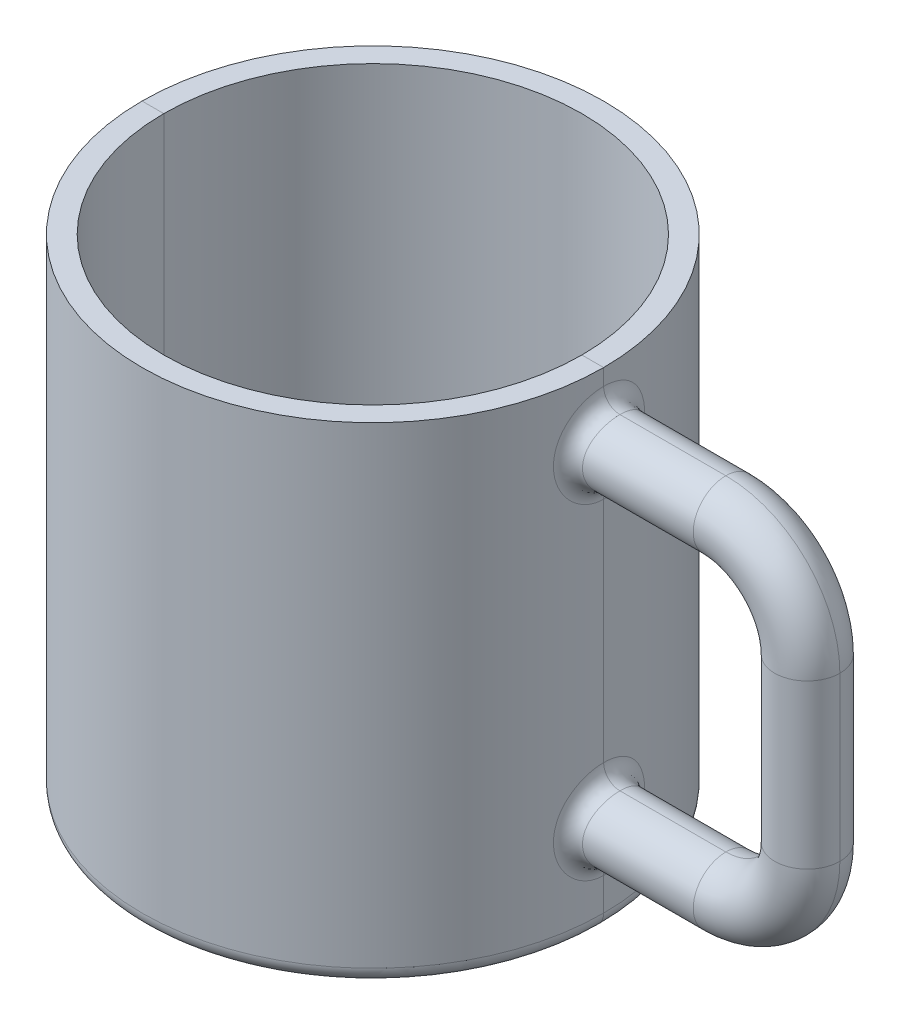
ISO-10303-21;
HEADER;
FILE_DESCRIPTION(('STEP AP214'),'2;1');
FILE_NAME('part.step','',(''),(''),'','','');
FILE_SCHEMA(('AUTOMOTIVE_DESIGN { 1 0 10303 214 1 1 1 1 }'));
ENDSEC;
DATA;
#1=APPLICATION_CONTEXT('core data for automotive mechanical design processes');
#2=APPLICATION_PROTOCOL_DEFINITION('international standard','automotive_design',2000,#1);
#3=PRODUCT_CONTEXT('',#1,'mechanical');
#4=PRODUCT('Part','Part','',(#3));
#5=PRODUCT_RELATED_PRODUCT_CATEGORY('part','',(#4));
#6=PRODUCT_DEFINITION_FORMATION('','',#4);
#7=PRODUCT_DEFINITION_CONTEXT('part definition',#1,'design');
#8=PRODUCT_DEFINITION('design','',#6,#7);
#9=PRODUCT_DEFINITION_SHAPE('','',#8);
#10=(LENGTH_UNIT() NAMED_UNIT(*) SI_UNIT(.MILLI.,.METRE.));
#11=(NAMED_UNIT(*) PLANE_ANGLE_UNIT() SI_UNIT($,.RADIAN.));
#12=(NAMED_UNIT(*) SI_UNIT($,.STERADIAN.) SOLID_ANGLE_UNIT());
#13=UNCERTAINTY_MEASURE_WITH_UNIT(LENGTH_MEASURE(1.E-05),#10,'distance_accuracy_value','');
#14=(GEOMETRIC_REPRESENTATION_CONTEXT(3) GLOBAL_UNCERTAINTY_ASSIGNED_CONTEXT((#13)) GLOBAL_UNIT_ASSIGNED_CONTEXT((#10,
#11,#12)) REPRESENTATION_CONTEXT('',''));
#15=CARTESIAN_POINT('',(0.,0.,0.));
#16=DIRECTION('',(0.,0.,1.));
#17=DIRECTION('',(1.,0.,0.));
#18=AXIS2_PLACEMENT_3D('',#15,#16,#17);
#19=CARTESIAN_POINT('',(-42.501,78.,0.));
#20=DIRECTION('',(1.,0.,0.));
#21=DIRECTION('',(0.,0.,-1.));
#22=AXIS2_PLACEMENT_3D('',#19,#20,#21);
#23=CYLINDRICAL_SURFACE('',#22,6.00000000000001);
#24=DIRECTION('',(1.,0.,0.));
#25=VECTOR('',#24,1.);
#26=CARTESIAN_POINT('',(-42.501,72.,0.));
#27=LINE('',#26,#25);
#28=CARTESIAN_POINT('',(45.5,72.,1.79037993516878E-11));
#29=VERTEX_POINT('',#28);
#30=CARTESIAN_POINT('',(65.,72.,0.));
#31=VERTEX_POINT('',#30);
#32=EDGE_CURVE('E11',#29,#31,#27,.T.);
#33=ORIENTED_EDGE('',*,*,#32,.F.);
#34=CARTESIAN_POINT('',(41.6603733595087,78.0928463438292,-8.40614605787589));
#35=CARTESIAN_POINT('',(42.1459557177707,78.0670079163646,-5.99962799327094));
#36=CARTESIAN_POINT('',(44.6011055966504,78.0618975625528,-5.99968071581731));
#37=CARTESIAN_POINT('',(41.6594032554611,77.5944217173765,-8.410951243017));
#38=CARTESIAN_POINT('',(42.1454378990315,77.7073431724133,-6.00362473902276));
#39=CARTESIAN_POINT('',(44.6000670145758,77.7296144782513,-6.00311029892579));
#40=CARTESIAN_POINT('',(41.6663153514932,77.0955687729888,-8.37697287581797));
#41=CARTESIAN_POINT('',(42.1491582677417,77.3466595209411,-5.97520816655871));
#42=CARTESIAN_POINT('',(44.6074670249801,77.3970458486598,-5.97885907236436));
#43=CARTESIAN_POINT('',(41.6950890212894,76.1112441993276,-8.23255032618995));
#44=CARTESIAN_POINT('',(42.1643794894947,76.639570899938,-5.85559955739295));
#45=CARTESIAN_POINT('',(44.6382717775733,76.7408294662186,-5.87578101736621));
#46=CARTESIAN_POINT('',(41.7169505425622,75.625772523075,-8.1221064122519));
#47=CARTESIAN_POINT('',(42.1759247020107,76.2921648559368,-5.76405432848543));
#48=CARTESIAN_POINT('',(44.6616764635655,76.4171816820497,-5.79695438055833));
#49=CARTESIAN_POINT('',(41.773052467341,74.6825779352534,-7.82842329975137));
#50=CARTESIAN_POINT('',(42.2047807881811,75.6248348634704,-5.52401565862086));
#51=CARTESIAN_POINT('',(44.7217385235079,75.7883852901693,-5.58734525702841));
#52=CARTESIAN_POINT('',(41.8072722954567,74.2248103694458,-7.64530504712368));
#53=CARTESIAN_POINT('',(42.2221510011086,75.3041696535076,-5.37499334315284));
#54=CARTESIAN_POINT('',(44.7583738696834,75.4832069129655,-5.45664909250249));
#55=CARTESIAN_POINT('',(41.8842578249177,73.3483975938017,-7.21160533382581));
#56=CARTESIAN_POINT('',(42.2598897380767,74.6998112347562,-5.02831115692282));
#57=CARTESIAN_POINT('',(44.8407936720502,74.8989317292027,-5.14710655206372));
#58=CARTESIAN_POINT('',(41.9270244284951,72.9297565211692,-6.96101674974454));
#59=CARTESIAN_POINT('',(42.2803173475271,74.4158502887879,-4.82994010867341));
#60=CARTESIAN_POINT('',(44.8865790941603,74.6198376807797,-4.96825509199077));
#61=CARTESIAN_POINT('',(42.017187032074,72.1358769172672,-6.39448314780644));
#62=CARTESIAN_POINT('',(42.3215872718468,73.8876539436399,-4.39087095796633));
#63=CARTESIAN_POINT('',(44.9831061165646,74.0905846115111,-4.5639056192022));
#64=CARTESIAN_POINT('',(42.064649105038,71.7614923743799,-6.07750427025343));
#65=CARTESIAN_POINT('',(42.3424490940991,73.6443801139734,-4.14894553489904));
#66=CARTESIAN_POINT('',(45.0339184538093,73.8409949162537,-4.33766971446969));
#67=CARTESIAN_POINT('',(42.158318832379,71.0745562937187,-5.38947753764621));
#68=CARTESIAN_POINT('',(42.3816342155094,73.2077290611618,-3.63629524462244));
#69=CARTESIAN_POINT('',(45.1342001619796,73.3830375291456,-3.84660749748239));
#70=CARTESIAN_POINT('',(42.2045264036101,70.7620088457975,-5.01842610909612));
#71=CARTESIAN_POINT('',(42.3999298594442,73.0148821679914,-3.3652946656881));
#72=CARTESIAN_POINT('',(45.1836694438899,73.1746725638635,-3.5817786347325));
#73=CARTESIAN_POINT('',(42.2909989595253,70.2048177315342,-4.22853027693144));
#74=CARTESIAN_POINT('',(42.4324639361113,72.6784869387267,-2.80219091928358));
#75=CARTESIAN_POINT('',(45.2762459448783,72.8032118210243,-3.01800984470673));
#76=CARTESIAN_POINT('',(42.3312046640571,69.9608327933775,-3.80927338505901));
#77=CARTESIAN_POINT('',(42.4465990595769,72.5361483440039,-2.51011659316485));
#78=CARTESIAN_POINT('',(45.3192896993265,72.6405551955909,-2.7187755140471));
#79=CARTESIAN_POINT('',(42.4006130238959,69.5519631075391,-2.93750891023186));
#80=CARTESIAN_POINT('',(42.4699348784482,72.3018057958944,-1.91564027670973));
#81=CARTESIAN_POINT('',(45.3935974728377,72.3679754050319,-2.09657498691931));
#82=CARTESIAN_POINT('',(42.4298166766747,69.3870711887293,-2.48500434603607));
#83=CARTESIAN_POINT('',(42.4790680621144,72.2104860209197,-1.6138776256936));
#84=CARTESIAN_POINT('',(45.4248625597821,72.2580474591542,-1.77361094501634));
#85=CARTESIAN_POINT('',(42.4736212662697,69.1430732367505,-1.56545983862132));
#86=CARTESIAN_POINT('',(42.4924247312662,72.0765067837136,-1.00922172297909));
#87=CARTESIAN_POINT('',(45.4717592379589,72.0953821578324,-1.11730859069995));
#88=CARTESIAN_POINT('',(42.4883968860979,69.0629399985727,-1.09866619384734));
#89=CARTESIAN_POINT('',(42.4966613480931,72.0337198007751,-0.70732817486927));
#90=CARTESIAN_POINT('',(45.4875778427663,72.041959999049,-0.78414606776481));
#91=CARTESIAN_POINT('',(42.5022994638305,68.9874831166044,-0.158924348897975));
#92=CARTESIAN_POINT('',(42.5006701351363,71.9932482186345,-0.101569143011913));
#93=CARTESIAN_POINT('',(45.5024617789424,71.9916554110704,-0.113428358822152));
#94=CARTESIAN_POINT('',(42.5014279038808,68.992151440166,0.314023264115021));
#95=CARTESIAN_POINT('',(42.5004278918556,71.995709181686,0.201172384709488));
#96=CARTESIAN_POINT('',(45.5015286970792,71.9947676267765,0.224126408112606));
#97=CARTESIAN_POINT('',(42.4842661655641,69.0854388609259,1.245414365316));
#98=CARTESIAN_POINT('',(42.4954618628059,72.0458181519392,0.80227964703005));
#99=CARTESIAN_POINT('',(45.4831555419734,72.056959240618,0.888883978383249));
#100=CARTESIAN_POINT('',(42.4681988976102,69.1728442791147,1.70396868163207));
#101=CARTESIAN_POINT('',(42.4908206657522,72.0926333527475,1.09956283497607));
#102=CARTESIAN_POINT('',(45.4659541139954,72.1152295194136,1.21616588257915));
#103=CARTESIAN_POINT('',(42.4227288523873,69.427120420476,2.60072477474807));
#104=CARTESIAN_POINT('',(42.4768476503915,72.2327276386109,1.69092235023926));
#105=CARTESIAN_POINT('',(45.4172744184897,72.2847469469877,1.85620356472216));
#106=CARTESIAN_POINT('',(42.3933256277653,69.5939938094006,3.03892586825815));
#107=CARTESIAN_POINT('',(42.467561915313,72.3255476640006,1.98411082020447));
#108=CARTESIAN_POINT('',(45.3857956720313,72.3959958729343,2.16895885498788));
#109=CARTESIAN_POINT('',(42.324177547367,70.0033298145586,3.88528259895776));
#110=CARTESIAN_POINT('',(42.4441432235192,72.5609276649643,2.56288225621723));
#111=CARTESIAN_POINT('',(45.3117665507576,72.6688865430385,2.77302522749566));
#112=CARTESIAN_POINT('',(42.2843782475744,70.2461917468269,4.29326509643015));
#113=CARTESIAN_POINT('',(42.430048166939,72.7031040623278,2.84785879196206));
#114=CARTESIAN_POINT('',(45.2691578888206,72.8307944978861,3.06421273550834));
#115=CARTESIAN_POINT('',(42.1988081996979,70.8003292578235,5.06575236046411));
#116=CARTESIAN_POINT('',(42.3976899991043,73.0384535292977,3.399676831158));
#117=CARTESIAN_POINT('',(45.1775476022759,73.2002195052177,3.61555658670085));
#118=CARTESIAN_POINT('',(42.1530369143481,71.1116109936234,5.4302532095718));
#119=CARTESIAN_POINT('',(42.3794844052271,73.2309575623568,3.66637176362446));
#120=CARTESIAN_POINT('',(45.1285454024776,73.4077406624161,3.875710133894));
#121=CARTESIAN_POINT('',(42.0596488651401,71.8000496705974,6.11199937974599));
#122=CARTESIAN_POINT('',(42.3402891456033,73.6692552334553,4.1750281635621));
#123=CARTESIAN_POINT('',(45.0285652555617,73.8666997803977,4.36228975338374));
#124=CARTESIAN_POINT('',(42.0120139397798,72.1782396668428,6.4283326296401));
#125=CARTESIAN_POINT('',(42.319279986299,73.9154195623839,4.41682313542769));
#126=CARTESIAN_POINT('',(44.9775678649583,74.1188264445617,4.58806485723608));
#127=CARTESIAN_POINT('',(41.9209776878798,72.9865645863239,6.99749756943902));
#128=CARTESIAN_POINT('',(42.2774856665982,74.4540384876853,4.85849734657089));
#129=CARTESIAN_POINT('',(44.8801055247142,74.6577097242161,4.99429238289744));
#130=CARTESIAN_POINT('',(41.8775771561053,73.4167092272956,7.25031735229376));
#131=CARTESIAN_POINT('',(42.2566764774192,74.746349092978,5.05899535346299));
#132=CARTESIAN_POINT('',(44.8336414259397,74.9444728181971,5.17473630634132));
#133=CARTESIAN_POINT('',(41.7998454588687,74.3186333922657,7.68584501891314));
#134=CARTESIAN_POINT('',(42.2184385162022,75.369448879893,5.40769564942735));
#135=CARTESIAN_POINT('',(44.7504227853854,75.5457555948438,5.48558350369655));
#136=CARTESIAN_POINT('',(41.7655449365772,74.7905466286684,7.8683169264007));
#137=CARTESIAN_POINT('',(42.2009557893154,75.7006929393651,5.55648733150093));
#138=CARTESIAN_POINT('',(44.713701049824,75.8603644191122,5.61581835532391));
#139=CARTESIAN_POINT('',(41.7102933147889,75.7611348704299,8.15617768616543));
#140=CARTESIAN_POINT('',(42.1724483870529,76.3885970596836,5.79211020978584));
#141=CARTESIAN_POINT('',(44.6545493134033,76.5074232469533,5.82127191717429));
#142=CARTESIAN_POINT('',(41.6893293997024,76.2597836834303,8.26164055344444));
#143=CARTESIAN_POINT('',(42.1613444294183,76.7460106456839,5.87965160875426));
#144=CARTESIAN_POINT('',(44.6321055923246,76.8398557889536,5.89654345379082));
#145=CARTESIAN_POINT('',(41.666737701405,77.132509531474,8.37466448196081));
#146=CARTESIAN_POINT('',(42.1493609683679,77.3737736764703,5.97340022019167));
#147=CARTESIAN_POINT('',(44.6079191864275,77.4216730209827,5.97721151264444));
#148=CARTESIAN_POINT('',(41.6614146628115,77.5038193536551,8.40098493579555));
#149=CARTESIAN_POINT('',(42.1465114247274,77.6418833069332,5.99533592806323));
#150=CARTESIAN_POINT('',(44.6022204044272,77.6692129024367,5.99599709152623));
#151=CARTESIAN_POINT('',(41.6594763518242,78.2470984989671,8.41059204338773));
#152=CARTESIAN_POINT('',(42.1454771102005,78.1783025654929,6.00332462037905));
#153=CARTESIAN_POINT('',(44.6001452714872,78.1647323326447,6.00285392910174));
#154=CARTESIAN_POINT('',(41.6628608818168,78.6190678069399,8.39387967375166));
#155=CARTESIAN_POINT('',(42.1472904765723,78.4470666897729,5.98939196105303));
#156=CARTESIAN_POINT('',(44.6037687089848,78.4127118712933,5.99092588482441));
#157=CARTESIAN_POINT('',(41.6808651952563,79.4882043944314,8.30413631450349));
#158=CARTESIAN_POINT('',(42.1568639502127,79.0730204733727,5.91487038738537));
#159=CARTESIAN_POINT('',(44.6230439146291,78.9921362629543,5.92687376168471));
#160=CARTESIAN_POINT('',(41.6990239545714,79.9832984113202,8.21333416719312));
#161=CARTESIAN_POINT('',(42.1665216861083,79.4287102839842,5.83935709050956));
#162=CARTESIAN_POINT('',(44.6424844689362,79.3221989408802,5.86206595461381));
#163=CARTESIAN_POINT('',(41.7488627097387,80.9498997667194,7.95608792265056));
#164=CARTESIAN_POINT('',(42.1923968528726,80.11608926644,5.62817938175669));
#165=CARTESIAN_POINT('',(44.6958412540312,79.9665998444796,5.67846275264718));
#166=CARTESIAN_POINT('',(41.7805548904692,81.4213854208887,7.78957565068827));
#167=CARTESIAN_POINT('',(42.2086878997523,80.4485721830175,5.49187539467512));
#168=CARTESIAN_POINT('',(44.7297705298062,80.2809236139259,5.55961869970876));
#169=CARTESIAN_POINT('',(41.8537489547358,82.3268951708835,7.38616883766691));
#170=CARTESIAN_POINT('',(42.2450812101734,81.0777176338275,5.16729662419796));
#171=CARTESIAN_POINT('',(44.8081312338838,80.884596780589,5.27169697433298));
#172=CARTESIAN_POINT('',(41.8952403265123,82.7609587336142,7.14934964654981));
#173=CARTESIAN_POINT('',(42.2652461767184,81.3748179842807,4.97834838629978));
#174=CARTESIAN_POINT('',(44.8525514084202,81.173972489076,5.1026730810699));
#175=CARTESIAN_POINT('',(41.9833887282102,83.5804837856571,6.6120306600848));
#176=CARTESIAN_POINT('',(42.3063515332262,81.9253327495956,4.55846247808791));
#177=CARTESIAN_POINT('',(44.9469220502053,81.7203225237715,4.7191748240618));
#178=CARTESIAN_POINT('',(42.0300452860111,83.9659497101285,6.31153668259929));
#179=CARTESIAN_POINT('',(42.3273245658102,82.1786906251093,4.32688029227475));
#180=CARTESIAN_POINT('',(44.9968720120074,81.9772998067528,4.50470461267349));
#181=CARTESIAN_POINT('',(42.123981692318,84.6825657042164,5.65089425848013));
#182=CARTESIAN_POINT('',(42.3675752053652,82.639717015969,3.82950905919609));
#183=CARTESIAN_POINT('',(45.0974392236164,82.4550438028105,4.03318727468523));
#184=CARTESIAN_POINT('',(42.1712621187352,85.0129857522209,5.29005456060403));
#185=CARTESIAN_POINT('',(42.3868100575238,82.8462956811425,3.56298826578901));
#186=CARTESIAN_POINT('',(45.1480570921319,82.6753238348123,3.77564678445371));
#187=CARTESIAN_POINT('',(42.2606016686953,85.6044793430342,4.52118274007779));
#188=CARTESIAN_POINT('',(42.4213283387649,83.2079516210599,3.00889847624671));
#189=CARTESIAN_POINT('',(45.2437029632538,83.0696528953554,3.22688336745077));
#190=CARTESIAN_POINT('',(42.3026606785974,85.8655513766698,4.11314959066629));
#191=CARTESIAN_POINT('',(42.4365552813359,83.3623359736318,2.72139072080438));
#192=CARTESIAN_POINT('',(45.2887308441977,83.2437009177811,2.9356597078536));
#193=CARTESIAN_POINT('',(42.3768887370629,86.3109390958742,3.26071713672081));
#194=CARTESIAN_POINT('',(42.4621891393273,83.6207224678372,2.1340569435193));
#195=CARTESIAN_POINT('',(45.3681985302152,83.5406260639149,2.32725693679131));
#196=CARTESIAN_POINT('',(42.409049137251,86.4951877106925,2.81628645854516));
#197=CARTESIAN_POINT('',(42.4725228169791,83.7239694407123,1.83475167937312));
#198=CARTESIAN_POINT('',(45.4026290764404,83.6634584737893,2.01005543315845));
#199=CARTESIAN_POINT('',(42.4597818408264,86.7808599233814,1.90404493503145));
#200=CARTESIAN_POINT('',(42.488323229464,83.882270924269,1.23025147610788));
#201=CARTESIAN_POINT('',(45.4569429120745,83.8539066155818,1.35896540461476));
#202=CARTESIAN_POINT('',(42.4783557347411,86.8822932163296,1.43623683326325));
#203=CARTESIAN_POINT('',(42.493736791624,83.9367960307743,0.92596806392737));
#204=CARTESIAN_POINT('',(45.4768279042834,83.921528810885,1.02507883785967));
#205=CARTESIAN_POINT('',(42.4996155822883,86.9980963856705,0.498821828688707));
#206=CARTESIAN_POINT('',(42.4999175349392,83.9991173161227,0.319937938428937));
#207=CARTESIAN_POINT('',(45.4995884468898,83.9987309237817,0.35602185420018));
#208=CARTESIAN_POINT('',(42.5025594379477,87.0138796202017,0.0293728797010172));
#209=CARTESIAN_POINT('',(42.5007378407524,84.0074474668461,0.0193060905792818));
#210=CARTESIAN_POINT('',(45.5027401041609,84.0092530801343,0.0209641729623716));
#211=CARTESIAN_POINT('',(42.4929276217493,86.9616785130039,-0.905260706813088));
#212=CARTESIAN_POINT('',(42.4979698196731,83.9794887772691,-0.582478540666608));
#213=CARTESIAN_POINT('',(45.4924283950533,83.9744523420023,-0.646107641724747));
#214=CARTESIAN_POINT('',(42.4803527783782,86.8936986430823,-1.37044557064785));
#215=CARTESIAN_POINT('',(42.4943918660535,83.943304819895,-0.882521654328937));
#216=CARTESIAN_POINT('',(45.4789659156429,83.9291324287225,-0.978121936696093));
#217=CARTESIAN_POINT('',(42.4412484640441,86.6770520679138,-2.27943850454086));
#218=CARTESIAN_POINT('',(42.482598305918,83.824893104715,-1.47789273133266));
#219=CARTESIAN_POINT('',(45.4371012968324,83.7847013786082,-1.62689336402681));
#220=CARTESIAN_POINT('',(42.4148346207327,86.5290536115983,-2.72339092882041));
#221=CARTESIAN_POINT('',(42.474461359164,83.7434485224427,-1.77228030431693));
#222=CARTESIAN_POINT('',(45.4088229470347,83.6860357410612,-1.94375352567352));
#223=CARTESIAN_POINT('',(42.3509849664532,86.1572728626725,-3.58183148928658));
#224=CARTESIAN_POINT('',(42.4533812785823,83.5320889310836,-2.35364722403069));
#225=CARTESIAN_POINT('',(45.3404662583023,83.4381819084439,-2.55644443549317));
#226=CARTESIAN_POINT('',(42.3135483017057,85.9334846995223,-3.99631734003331));
#227=CARTESIAN_POINT('',(42.4404984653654,83.4027807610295,-2.63997548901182));
#228=CARTESIAN_POINT('',(45.3003870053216,83.2889897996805,-2.85227355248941));
#229=CARTESIAN_POINT('',(42.2311457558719,85.4132603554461,-4.78973614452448));
#230=CARTESIAN_POINT('',(42.4101729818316,83.0919801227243,-3.20053497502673));
#231=CARTESIAN_POINT('',(45.212167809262,82.9421735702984,-3.41855677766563));
#232=CARTESIAN_POINT('',(42.1860919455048,85.1159544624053,-5.16816226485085));
#233=CARTESIAN_POINT('',(42.392736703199,82.9105360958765,-3.47434629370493));
#234=CARTESIAN_POINT('',(45.163933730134,82.7439696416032,-3.68864914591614));
#235=CARTESIAN_POINT('',(42.0936888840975,84.4583574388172,-5.87351076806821));
#236=CARTESIAN_POINT('',(42.3548645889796,82.4967497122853,-3.99534414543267));
#237=CARTESIAN_POINT('',(45.0650080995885,82.3055716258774,-4.19207435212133));
#238=CARTESIAN_POINT('',(42.0463393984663,84.0980598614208,-6.2004278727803));
#239=CARTESIAN_POINT('',(42.3344639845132,82.2649706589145,-4.24271410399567));
#240=CARTESIAN_POINT('',(45.0143162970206,82.0653732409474,-4.42540342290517));
#241=CARTESIAN_POINT('',(41.9538527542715,83.31842482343,-6.79833145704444));
#242=CARTESIAN_POINT('',(42.2928553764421,81.7508779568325,-4.70251387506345));
#243=CARTESIAN_POINT('',(44.9153011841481,81.5456165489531,-4.85214245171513));
#244=CARTESIAN_POINT('',(41.9087577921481,82.8983048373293,-7.06843524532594));
#245=CARTESIAN_POINT('',(42.2716254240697,81.4681008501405,-4.91497830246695));
#246=CARTESIAN_POINT('',(44.8670230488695,81.2655365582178,-5.04492241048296));
#247=CARTESIAN_POINT('',(41.8266977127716,82.0146080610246,-7.53887427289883));
#248=CARTESIAN_POINT('',(42.2318498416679,80.8623288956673,-5.2890964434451));
#249=CARTESIAN_POINT('',(44.7791704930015,80.6764053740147,-5.38068673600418));
#250=CARTESIAN_POINT('',(41.7897322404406,81.5510331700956,-7.73921255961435));
#251=CARTESIAN_POINT('',(42.2132465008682,80.539131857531,-5.4515062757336));
#252=CARTESIAN_POINT('',(44.7395956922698,80.3673554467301,-5.52367327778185));
#253=CARTESIAN_POINT('',(41.7284496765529,80.5962291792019,-8.06310650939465));
#254=CARTESIAN_POINT('',(42.1819251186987,79.8658811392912,-5.71545977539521));
#255=CARTESIAN_POINT('',(44.6739873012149,79.7308194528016,-5.75484464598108));
#256=CARTESIAN_POINT('',(41.7040601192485,80.1051770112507,-8.18710289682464));
#257=CARTESIAN_POINT('',(42.1690999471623,79.5153357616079,-5.81803933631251));
#258=CARTESIAN_POINT('',(44.6478761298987,79.4034513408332,-5.84334402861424));
#259=CARTESIAN_POINT('',(41.6705167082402,79.107178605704,-8.35617183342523));
#260=CARTESIAN_POINT('',(42.1514056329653,78.7995106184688,-5.95787301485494));
#261=CARTESIAN_POINT('',(44.6119649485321,78.7381190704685,-5.96401283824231));
#262=CARTESIAN_POINT('',(41.6613609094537,78.6002344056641,-8.40125445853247));
#263=CARTESIAN_POINT('',(42.1464829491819,78.4332104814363,-5.99555859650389));
#264=CARTESIAN_POINT('',(44.6021628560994,78.4001562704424,-5.99618945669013));
#265=CARTESIAN_POINT('',(41.6603733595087,78.0928463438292,-8.40614605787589));
#266=CARTESIAN_POINT('',(42.1459557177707,78.0670079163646,-5.99962799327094));
#267=CARTESIAN_POINT('',(44.6011055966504,78.0618975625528,-5.99968071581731));
#268=(BOUNDED_SURFACE() B_SPLINE_SURFACE(3,2,((#34,#35,#36),(#37,#38,#39),(#40,#41,#42),(#43,
#44,#45),(#46,#47,#48),(#49,#50,#51),(#52,#53,#54),(#55,#56,#57),(#58,#59,#60),(#61,#62,#63),
(#64,#65,#66),(#67,#68,#69),(#70,#71,#72),(#73,#74,#75),(#76,#77,#78),(#79,#80,#81),(#82,#83,
#84),(#85,#86,#87),(#88,#89,#90),(#91,#92,#93),(#94,#95,#96),(#97,#98,#99),(#100,#101,#102),
(#103,#104,#105),(#106,#107,#108),(#109,#110,#111),(#112,#113,#114),(#115,#116,#117),(#118,#119,
#120),(#121,#122,#123),(#124,#125,#126),(#127,#128,#129),(#130,#131,#132),(#133,#134,#135),
(#136,#137,#138),(#139,#140,#141),(#142,#143,#144),(#145,#146,#147),(#148,#149,#150),(#151,#152,
#153),(#154,#155,#156),(#157,#158,#159),(#160,#161,#162),(#163,#164,#165),(#166,#167,#168),
(#169,#170,#171),(#172,#173,#174),(#175,#176,#177),(#178,#179,#180),(#181,#182,#183),(#184,#185,
#186),(#187,#188,#189),(#190,#191,#192),(#193,#194,#195),(#196,#197,#198),(#199,#200,#201),
(#202,#203,#204),(#205,#206,#207),(#208,#209,#210),(#211,#212,#213),(#214,#215,#216),(#217,#218,
#219),(#220,#221,#222),(#223,#224,#225),(#226,#227,#228),(#229,#230,#231),(#232,#233,#234),
(#235,#236,#237),(#238,#239,#240),(#241,#242,#243),(#244,#245,#246),(#247,#248,#249),(#250,#251,
#252),(#253,#254,#255),(#256,#257,#258),(#259,#260,#261),(#262,#263,#264),(#265,#266,#267)),
.UNSPECIFIED.,.T.,.F.,.F.) B_SPLINE_SURFACE_WITH_KNOTS((4,2,2,2,2,2,2,2,2,2,2,2,2,2,2,2,2,2,2,2,
2,2,2,2,2,2,2,2,2,2,2,2,2,2,2,2,2,2,4),(3,3),(0.,1.49354896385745,2.98709268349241,
4.47816117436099,5.96938715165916,7.48583861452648,9.00239034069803,10.533049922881,
12.0635706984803,13.5753225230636,15.0869311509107,16.576703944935,18.0665267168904,
19.5643137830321,21.0622356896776,22.5857072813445,24.1094642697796,25.6382890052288,
27.1656424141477,28.2800822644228,29.3944968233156,30.9016289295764,32.4101208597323,
33.9170018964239,35.4237453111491,36.9491071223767,38.4745021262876,40.0012261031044,
41.527771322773,43.029047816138,44.5302441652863,46.0190931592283,47.508057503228,
49.0155579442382,50.52321275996,52.0527968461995,53.5823141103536,55.1029165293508,
56.6233247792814),(0.,1.),
.UNSPECIFIED.) GEOMETRIC_REPRESENTATION_ITEM() RATIONAL_B_SPLINE_SURFACE(((1.,0.773880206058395,
1.),(1.,0.773953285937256,1.),(1.,0.773433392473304,1.),(1.,0.771260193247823,1.),(1.,
0.769606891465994,1.),(1.,0.765336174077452,1.),(1.,0.762720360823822,1.),(1.,0.756786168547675,
1.),(1.,0.753467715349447,1.),(1.,0.746405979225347,1.),(1.,0.742656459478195,1.),(1.,
0.735185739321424,1.),(1.,0.731464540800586,1.),(1.,0.724441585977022,1.),(1.,0.721144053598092,
1.),(1.,0.715415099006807,1.),(1.,0.712983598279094,1.),(1.,0.709324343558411,1.),(1.,
0.708082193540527,1.),(1.,0.706913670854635,1.),(1.,0.706987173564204,1.),(1.,0.708429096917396,
1.),(1.,0.709778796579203,1.),(1.,0.713573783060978,1.),(1.,0.716019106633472,1.),(1.,
0.72172103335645,1.),(1.,0.724981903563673,1.),(1.,0.731925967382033,1.),(1.,0.735609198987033,
1.),(1.,0.743052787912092,1.),(1.,0.74681338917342,1.),(1.,0.753938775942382,1.),(1.,
0.757303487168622,1.),(1.,0.763289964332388,1.),(1.,0.765909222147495,1.),(1.,0.770111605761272,
1.),(1.,0.771695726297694,1.),(1.,0.773400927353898,1.),(1.,0.773801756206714,1.),(1.,
0.77394778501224,1.),(1.,0.773692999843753,1.),(1.,0.772335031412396,1.),(1.,0.770964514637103,
1.),(1.,0.767180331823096,1.),(1.,0.764765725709,1.),(1.,0.759143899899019,1.),(1.,
0.755937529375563,1.),(1.,0.749062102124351,1.),(1.,0.745393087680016,1.),(1.,0.737935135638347,
1.),(1.,0.734145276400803,1.),(1.,0.726920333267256,1.),(1.,0.723485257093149,1.),(1.,
0.717380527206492,1.),(1.,0.714711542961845,1.),(1.,0.710483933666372,1.),(1.,0.70892517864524,
1.),(1.,0.70713983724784,1.),(1.,0.706891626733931,1.),(1.,0.70770147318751,1.),(1.,
0.708759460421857,1.),(1.,0.712030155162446,1.),(1.,0.714233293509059,1.),(1.,0.719515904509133,
1.),(1.,0.722595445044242,1.),(1.,0.729310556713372,1.),(1.,0.732952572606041,1.),(1.,
0.740349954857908,1.),(1.,0.744105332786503,1.),(1.,0.751375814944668,1.),(1.,0.754886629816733,
1.),(1.,0.761229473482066,1.),(1.,0.764061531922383,1.),(1.,0.768734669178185,1.),(1.,
0.770581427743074,1.),(1.,0.773116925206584,1.),(1.,0.77380581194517,1.),(1.,0.773880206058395,1.))) REPRESENTATION_ITEM('') SURFACE());
#269=CARTESIAN_POINT('',(44.6011055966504,78.0618975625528,-5.99968071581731));
#270=CARTESIAN_POINT('',(44.6021628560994,78.4001562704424,-5.99618945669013));
#271=CARTESIAN_POINT('',(44.6119649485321,78.7381190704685,-5.96401283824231));
#272=CARTESIAN_POINT('',(44.6478761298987,79.4034513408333,-5.84334402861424));
#273=CARTESIAN_POINT('',(44.6739873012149,79.7308194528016,-5.75484464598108));
#274=CARTESIAN_POINT('',(44.7395956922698,80.3673554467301,-5.52367327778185));
#275=CARTESIAN_POINT('',(44.7791704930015,80.6764053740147,-5.38068673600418));
#276=CARTESIAN_POINT('',(44.8670230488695,81.2655365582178,-5.04492241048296));
#277=CARTESIAN_POINT('',(44.9153011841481,81.5456165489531,-4.85214245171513));
#278=CARTESIAN_POINT('',(45.0143162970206,82.0653732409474,-4.42540342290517));
#279=CARTESIAN_POINT('',(45.0650080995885,82.3055716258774,-4.19207435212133));
#280=CARTESIAN_POINT('',(45.163933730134,82.7439696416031,-3.68864914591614));
#281=CARTESIAN_POINT('',(45.212167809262,82.9421735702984,-3.41855677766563));
#282=CARTESIAN_POINT('',(45.3003870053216,83.2889897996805,-2.85227355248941));
#283=CARTESIAN_POINT('',(45.3404662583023,83.4381819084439,-2.55644443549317));
#284=CARTESIAN_POINT('',(45.4088229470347,83.6860357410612,-1.94375352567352));
#285=CARTESIAN_POINT('',(45.4371012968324,83.7847013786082,-1.62689336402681));
#286=CARTESIAN_POINT('',(45.4789659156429,83.9291324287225,-0.978121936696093));
#287=CARTESIAN_POINT('',(45.4924283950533,83.9744523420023,-0.646107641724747));
#288=CARTESIAN_POINT('',(45.5027401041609,84.0092530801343,0.0209641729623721));
#289=CARTESIAN_POINT('',(45.4995884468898,83.9987309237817,0.35602185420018));
#290=CARTESIAN_POINT('',(45.4768279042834,83.921528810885,1.02507883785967));
#291=CARTESIAN_POINT('',(45.4569429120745,83.8539066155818,1.35896540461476));
#292=CARTESIAN_POINT('',(45.4026290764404,83.6634584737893,2.01005543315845));
#293=CARTESIAN_POINT('',(45.3681985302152,83.5406260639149,2.32725693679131));
#294=CARTESIAN_POINT('',(45.2887308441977,83.2437009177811,2.9356597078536));
#295=CARTESIAN_POINT('',(45.2437029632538,83.0696528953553,3.22688336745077));
#296=CARTESIAN_POINT('',(45.1480570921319,82.6753238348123,3.77564678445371));
#297=CARTESIAN_POINT('',(45.0974392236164,82.4550438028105,4.03318727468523));
#298=CARTESIAN_POINT('',(44.9968720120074,81.9772998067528,4.50470461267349));
#299=CARTESIAN_POINT('',(44.9469220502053,81.7203225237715,4.7191748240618));
#300=CARTESIAN_POINT('',(44.8525514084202,81.173972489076,5.1026730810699));
#301=CARTESIAN_POINT('',(44.8081312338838,80.884596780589,5.27169697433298));
#302=CARTESIAN_POINT('',(44.7297705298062,80.2809236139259,5.55961869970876));
#303=CARTESIAN_POINT('',(44.6958412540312,79.9665998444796,5.67846275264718));
#304=CARTESIAN_POINT('',(44.6424844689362,79.3221989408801,5.86206595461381));
#305=CARTESIAN_POINT('',(44.6230439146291,78.9921362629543,5.92687376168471));
#306=CARTESIAN_POINT('',(44.6037687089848,78.4127118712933,5.99092588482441));
#307=CARTESIAN_POINT('',(44.6001452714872,78.1647323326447,6.00285392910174));
#308=CARTESIAN_POINT('',(44.6022204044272,77.6692129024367,5.99599709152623));
#309=CARTESIAN_POINT('',(44.6079191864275,77.4216730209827,5.97721151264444));
#310=CARTESIAN_POINT('',(44.6321055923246,76.8398557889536,5.89654345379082));
#311=CARTESIAN_POINT('',(44.6545493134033,76.5074232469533,5.82127191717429));
#312=CARTESIAN_POINT('',(44.713701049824,75.8603644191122,5.61581835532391));
#313=CARTESIAN_POINT('',(44.7504227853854,75.5457555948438,5.48558350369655));
#314=CARTESIAN_POINT('',(44.8336414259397,74.9444728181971,5.17473630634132));
#315=CARTESIAN_POINT('',(44.8801055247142,74.6577097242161,4.99429238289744));
#316=CARTESIAN_POINT('',(44.9775678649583,74.1188264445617,4.58806485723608));
#317=CARTESIAN_POINT('',(45.0285652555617,73.8666997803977,4.36228975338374));
#318=CARTESIAN_POINT('',(45.1285454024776,73.4077406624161,3.875710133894));
#319=CARTESIAN_POINT('',(45.1775476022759,73.2002195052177,3.61555658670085));
#320=CARTESIAN_POINT('',(45.2691578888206,72.8307944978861,3.06421273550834));
#321=CARTESIAN_POINT('',(45.3117665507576,72.6688865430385,2.77302522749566));
#322=CARTESIAN_POINT('',(45.3857956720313,72.3959958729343,2.16895885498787));
#323=CARTESIAN_POINT('',(45.4172744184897,72.2847469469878,1.85620356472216));
#324=CARTESIAN_POINT('',(45.4659541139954,72.1152295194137,1.21616588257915));
#325=CARTESIAN_POINT('',(45.4831555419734,72.056959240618,0.88888397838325));
#326=CARTESIAN_POINT('',(45.5015286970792,71.9947676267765,0.224126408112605));
#327=CARTESIAN_POINT('',(45.5024617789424,71.9916554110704,-0.113428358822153));
#328=CARTESIAN_POINT('',(45.4875778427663,72.041959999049,-0.784146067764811));
#329=CARTESIAN_POINT('',(45.4717592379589,72.0953821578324,-1.11730859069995));
#330=CARTESIAN_POINT('',(45.4248625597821,72.2580474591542,-1.77361094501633));
#331=CARTESIAN_POINT('',(45.3935974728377,72.3679754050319,-2.09657498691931));
#332=CARTESIAN_POINT('',(45.3192896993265,72.6405551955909,-2.7187755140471));
#333=CARTESIAN_POINT('',(45.2762459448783,72.8032118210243,-3.01800984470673));
#334=CARTESIAN_POINT('',(45.1836694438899,73.1746725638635,-3.5817786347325));
#335=CARTESIAN_POINT('',(45.1342001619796,73.3830375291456,-3.84660749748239));
#336=CARTESIAN_POINT('',(45.0339184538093,73.8409949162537,-4.33766971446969));
#337=CARTESIAN_POINT('',(44.9831061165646,74.0905846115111,-4.5639056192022));
#338=CARTESIAN_POINT('',(44.8865790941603,74.6198376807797,-4.96825509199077));
#339=CARTESIAN_POINT('',(44.8407936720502,74.8989317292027,-5.14710655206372));
#340=CARTESIAN_POINT('',(44.7583738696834,75.4832069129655,-5.45664909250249));
#341=CARTESIAN_POINT('',(44.7217385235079,75.7883852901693,-5.58734525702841));
#342=CARTESIAN_POINT('',(44.6616764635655,76.4171816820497,-5.79695438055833));
#343=CARTESIAN_POINT('',(44.6382717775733,76.7408294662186,-5.87578101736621));
#344=CARTESIAN_POINT('',(44.6074670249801,77.3970458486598,-5.97885907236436));
#345=CARTESIAN_POINT('',(44.6000670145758,77.7296144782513,-6.00311029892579));
#346=CARTESIAN_POINT('',(44.6011055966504,78.0618975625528,-5.99968071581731));
#347=B_SPLINE_CURVE_WITH_KNOTS('',3,(#269,#270,#271,#272,#273,#274,#275,#276,#277,#278,#279,
#280,#281,#282,#283,#284,#285,#286,#287,#288,#289,#290,#291,#292,#293,#294,#295,#296,#297,#298,
#299,#300,#301,#302,#303,#304,#305,#306,#307,#308,#309,#310,#311,#312,#313,#314,#315,#316,#317,
#318,#319,#320,#321,#322,#323,#324,#325,#326,#327,#328,#329,#330,#331,#332,#333,#334,#335,#336,
#337,#338,#339,#340,#341,#342,#343,#344,#345,#346),.UNSPECIFIED.,.T.,.F.,(4,2,2,2,2,2,2,2,2,2,2,
2,2,2,2,2,2,2,2,2,2,2,2,2,2,2,2,2,2,2,2,2,2,2,2,2,2,2,4),(0.,1.52040824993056,3.04101066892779,
4.57052793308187,6.10011201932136,7.6077668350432,9.11526727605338,10.6042316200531,
12.0930806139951,13.5942769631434,15.0955534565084,16.622098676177,18.1488226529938,
19.6742176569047,21.1995794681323,22.7063228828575,24.2132039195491,25.721695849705,
27.2288279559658,28.3432425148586,29.4576823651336,30.9850357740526,32.5138605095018,
34.0376174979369,35.5610890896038,37.0590109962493,38.556798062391,40.0466208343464,
41.5363936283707,43.0480022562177,44.5597540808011,46.0902748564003,47.6209344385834,
49.1374861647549,50.6539376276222,52.1451636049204,53.636232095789,55.1297758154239,
56.6233247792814),.UNSPECIFIED.);
#348=CARTESIAN_POINT('',(45.5,84.,-1.67060547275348E-12));
#349=VERTEX_POINT('',#348);
#350=EDGE_CURVE('E262',#29,#349,#347,.T.);
#351=ORIENTED_EDGE('',*,*,#350,.T.);
#352=DIRECTION('',(1.,0.,0.));
#353=VECTOR('',#352,1.);
#354=CARTESIAN_POINT('',(-42.501,84.,0.));
#355=LINE('',#354,#353);
#356=CARTESIAN_POINT('',(65.,84.,0.));
#357=VERTEX_POINT('',#356);
#358=EDGE_CURVE('E41',#357,#349,#355,.F.);
#359=ORIENTED_EDGE('',*,*,#358,.F.);
#360=CARTESIAN_POINT('',(65.,78.,0.));
#361=DIRECTION('',(1.,0.,0.));
#362=DIRECTION('',(0.,0.,-1.));
#363=AXIS2_PLACEMENT_3D('',#360,#361,#362);
#364=CIRCLE('',#363,6.);
#365=EDGE_CURVE('E380',#31,#357,#364,.T.);
#366=ORIENTED_EDGE('',*,*,#365,.F.);
#367=EDGE_LOOP('',(#33,#351,#359,#366));
#368=FACE_BOUND('',#367,.T.);
#369=ADVANCED_FACE('F30',(#368),#23,.T.);
#370=CARTESIAN_POINT('',(65.,63.,0.));
#371=DIRECTION('',(0.,0.,-1.));
#372=DIRECTION('',(-1.,0.,0.));
#373=AXIS2_PLACEMENT_3D('',#370,#371,#372);
#374=TOROIDAL_SURFACE('',#373,15.,6.);
#375=ORIENTED_EDGE('',*,*,#365,.T.);
#376=CARTESIAN_POINT('',(65.,63.,0.));
#377=DIRECTION('',(0.,0.,1.));
#378=DIRECTION('',(1.,0.,0.));
#379=AXIS2_PLACEMENT_3D('',#376,#377,#378);
#380=CIRCLE('',#379,21.);
#381=CARTESIAN_POINT('',(86.,63.,0.));
#382=VERTEX_POINT('',#381);
#383=EDGE_CURVE('E282',#357,#382,#380,.F.);
#384=ORIENTED_EDGE('',*,*,#383,.T.);
#385=CARTESIAN_POINT('',(80.,63.,0.));
#386=DIRECTION('',(0.,-1.,0.));
#387=DIRECTION('',(0.,0.,-1.));
#388=AXIS2_PLACEMENT_3D('',#385,#386,#387);
#389=CIRCLE('',#388,6.);
#390=CARTESIAN_POINT('',(74.,63.,0.));
#391=VERTEX_POINT('',#390);
#392=EDGE_CURVE('E372',#391,#382,#389,.T.);
#393=ORIENTED_EDGE('',*,*,#392,.F.);
#394=CARTESIAN_POINT('',(65.,63.,0.));
#395=DIRECTION('',(0.,0.,-1.));
#396=DIRECTION('',(-1.,0.,0.));
#397=AXIS2_PLACEMENT_3D('',#394,#395,#396);
#398=CIRCLE('',#397,9.);
#399=EDGE_CURVE('E279',#391,#31,#398,.F.);
#400=ORIENTED_EDGE('',*,*,#399,.T.);
#401=EDGE_LOOP('',(#375,#384,#393,#400));
#402=FACE_BOUND('',#401,.T.);
#403=ADVANCED_FACE('F229',(#402),#374,.T.);
#404=CARTESIAN_POINT('',(80.,63.,0.));
#405=DIRECTION('',(0.,-1.,0.));
#406=DIRECTION('',(1.,0.,0.));
#407=AXIS2_PLACEMENT_3D('',#404,#405,#406);
#408=CYLINDRICAL_SURFACE('',#407,6.);
#409=CARTESIAN_POINT('',(80.,33.,0.));
#410=DIRECTION('',(0.,-1.,0.));
#411=DIRECTION('',(0.,0.,-1.));
#412=AXIS2_PLACEMENT_3D('',#409,#410,#411);
#413=CIRCLE('',#412,6.);
#414=CARTESIAN_POINT('',(74.,33.,0.));
#415=VERTEX_POINT('',#414);
#416=CARTESIAN_POINT('',(86.,33.,0.));
#417=VERTEX_POINT('',#416);
#418=EDGE_CURVE('E369',#415,#417,#413,.T.);
#419=ORIENTED_EDGE('',*,*,#418,.F.);
#420=DIRECTION('',(0.,-1.,0.));
#421=VECTOR('',#420,1.);
#422=CARTESIAN_POINT('',(74.,63.,0.));
#423=LINE('',#422,#421);
#424=EDGE_CURVE('E283',#415,#391,#423,.F.);
#425=ORIENTED_EDGE('',*,*,#424,.T.);
#426=ORIENTED_EDGE('',*,*,#392,.T.);
#427=DIRECTION('',(0.,-1.,0.));
#428=VECTOR('',#427,1.);
#429=CARTESIAN_POINT('',(86.,63.,0.));
#430=LINE('',#429,#428);
#431=EDGE_CURVE('E287',#382,#417,#430,.T.);
#432=ORIENTED_EDGE('',*,*,#431,.T.);
#433=EDGE_LOOP('',(#419,#425,#426,#432));
#434=FACE_BOUND('',#433,.T.);
#435=ADVANCED_FACE('F233',(#434),#408,.T.);
#436=CARTESIAN_POINT('',(65.,33.,0.));
#437=DIRECTION('',(0.,0.,-1.));
#438=DIRECTION('',(-1.,0.,0.));
#439=AXIS2_PLACEMENT_3D('',#436,#437,#438);
#440=TOROIDAL_SURFACE('',#439,15.,6.);
#441=ORIENTED_EDGE('',*,*,#418,.T.);
#442=CARTESIAN_POINT('',(65.,33.,0.));
#443=DIRECTION('',(0.,0.,1.));
#444=DIRECTION('',(1.,0.,0.));
#445=AXIS2_PLACEMENT_3D('',#442,#443,#444);
#446=CIRCLE('',#445,21.);
#447=CARTESIAN_POINT('',(65.,12.,0.));
#448=VERTEX_POINT('',#447);
#449=EDGE_CURVE('E292',#417,#448,#446,.F.);
#450=ORIENTED_EDGE('',*,*,#449,.T.);
#451=CARTESIAN_POINT('',(65.,18.,0.));
#452=DIRECTION('',(-1.,0.,0.));
#453=DIRECTION('',(0.,0.,-1.));
#454=AXIS2_PLACEMENT_3D('',#451,#452,#453);
#455=CIRCLE('',#454,6.);
#456=CARTESIAN_POINT('',(65.,24.,0.));
#457=VERTEX_POINT('',#456);
#458=EDGE_CURVE('E366',#457,#448,#455,.T.);
#459=ORIENTED_EDGE('',*,*,#458,.F.);
#460=CARTESIAN_POINT('',(65.,33.,0.));
#461=DIRECTION('',(0.,0.,-1.));
#462=DIRECTION('',(-1.,0.,0.));
#463=AXIS2_PLACEMENT_3D('',#460,#461,#462);
#464=CIRCLE('',#463,8.99999999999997);
#465=EDGE_CURVE('E288',#457,#415,#464,.F.);
#466=ORIENTED_EDGE('',*,*,#465,.T.);
#467=EDGE_LOOP('',(#441,#450,#459,#466));
#468=FACE_BOUND('',#467,.T.);
#469=ADVANCED_FACE('F236',(#468),#440,.T.);
#470=CARTESIAN_POINT('',(65.,18.,0.));
#471=DIRECTION('',(-1.,0.,0.));
#472=DIRECTION('',(0.,-1.,0.));
#473=AXIS2_PLACEMENT_3D('',#470,#471,#472);
#474=CYLINDRICAL_SURFACE('',#473,6.);
#475=CARTESIAN_POINT('',(45.4456387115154,23.8140090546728,-1.48232881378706));
#476=CARTESIAN_POINT('',(42.4849673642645,23.8486868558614,-1.3463150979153));
#477=CARTESIAN_POINT('',(42.4492229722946,26.7210135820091,-2.07688927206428));
#478=CARTESIAN_POINT('',(45.4695390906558,23.8970439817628,-1.15664730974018));
#479=CARTESIAN_POINT('',(42.4918146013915,23.9173548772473,-1.04511416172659));
#480=CARTESIAN_POINT('',(42.4715475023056,26.8455659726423,-1.62057727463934));
#481=CARTESIAN_POINT('',(45.486002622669,23.9527020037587,-0.823737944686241));
#482=CARTESIAN_POINT('',(42.496234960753,23.9619783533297,-0.74319043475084));
#483=CARTESIAN_POINT('',(42.486925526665,26.929053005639,-1.1541383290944));
#484=CARTESIAN_POINT('',(45.5021991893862,24.0074702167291,-0.153134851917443));
#485=CARTESIAN_POINT('',(42.5006023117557,24.0060620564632,-0.137290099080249));
#486=CARTESIAN_POINT('',(42.5020541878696,27.011205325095,-0.214557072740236));
#487=CARTESIAN_POINT('',(45.5019338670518,24.0065859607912,0.184558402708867));
#488=CARTESIAN_POINT('',(42.5005335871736,24.0053636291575,0.165564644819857));
#489=CARTESIAN_POINT('',(42.5018063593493,27.0098789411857,0.258584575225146));
#490=CARTESIAN_POINT('',(45.4848363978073,23.9487450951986,0.849889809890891));
#491=CARTESIAN_POINT('',(42.4959183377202,23.9587851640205,0.766914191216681));
#492=CARTESIAN_POINT('',(42.485836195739,26.923117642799,1.19077967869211));
#493=CARTESIAN_POINT('',(45.4682475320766,23.8926118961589,1.17760279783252));
#494=CARTESIAN_POINT('',(42.4914541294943,23.9137357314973,1.06432139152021));
#495=CARTESIAN_POINT('',(42.4703411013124,26.8389178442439,1.64993798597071));
#496=CARTESIAN_POINT('',(45.4206838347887,23.7272531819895,1.81885103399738));
#497=CARTESIAN_POINT('',(42.4778457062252,23.7772684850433,1.65610081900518));
#498=CARTESIAN_POINT('',(42.4259134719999,26.5908797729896,2.5483901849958));
#499=CARTESIAN_POINT('',(45.3897085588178,23.6180260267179,2.13238584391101));
#500=CARTESIAN_POINT('',(42.4687466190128,23.6863003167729,1.94957479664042));
#501=CARTESIAN_POINT('',(42.3969805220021,26.4270390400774,2.9876834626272));
#502=CARTESIAN_POINT('',(45.3165436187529,23.349080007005,2.73819810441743));
#503=CARTESIAN_POINT('',(42.4456985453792,23.4547620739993,2.52908281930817));
#504=CARTESIAN_POINT('',(42.3286396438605,26.0236200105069,3.83648635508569));
#505=CARTESIAN_POINT('',(45.2742996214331,23.1891157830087,3.03036358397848));
#506=CARTESIAN_POINT('',(42.4317892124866,23.3145929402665,2.81449989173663));
#507=CARTESIAN_POINT('',(42.2891809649,25.7836736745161,4.24583908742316));
#508=CARTESIAN_POINT('',(45.1832243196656,22.823401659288,3.58397647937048));
#509=CARTESIAN_POINT('',(42.3997590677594,22.9832947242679,3.36761355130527));
#510=CARTESIAN_POINT('',(42.204110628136,25.2351024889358,5.02150550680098));
#511=CARTESIAN_POINT('',(45.1343922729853,22.6176465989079,3.8454204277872));
#512=CARTESIAN_POINT('',(42.3816964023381,22.7928357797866,3.63514593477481));
#513=CARTESIAN_POINT('',(42.1584982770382,24.9264698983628,5.38781433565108));
#514=CARTESIAN_POINT('',(45.0345341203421,22.1620094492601,4.33490179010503));
#515=CARTESIAN_POINT('',(42.3427007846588,22.3585507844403,4.14598524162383));
#516=CARTESIAN_POINT('',(42.0652241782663,24.2430141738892,6.07362613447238));
#517=CARTESIAN_POINT('',(44.983484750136,21.9114311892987,4.56228948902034));
#518=CARTESIAN_POINT('',(42.3217483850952,22.11435874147,4.38911529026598));
#519=CARTESIAN_POINT('',(42.0175407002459,23.8671467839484,6.39221878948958));
#520=CARTESIAN_POINT('',(44.8857036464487,21.3754222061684,4.97195235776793));
#521=CARTESIAN_POINT('',(42.2799488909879,21.5794823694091,4.8339013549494));
#522=CARTESIAN_POINT('',(41.9262067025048,23.0631333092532,6.96619698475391));
#523=CARTESIAN_POINT('',(44.8389720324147,21.0899905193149,5.15422627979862));
#524=CARTESIAN_POINT('',(42.2590797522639,21.2889667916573,5.03617222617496));
#525=CARTESIAN_POINT('',(41.8825562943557,22.6349857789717,7.2215807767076));
#526=CARTESIAN_POINT('',(44.7550116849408,20.4910057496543,5.4689785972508));
#527=CARTESIAN_POINT('',(42.2205912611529,20.669012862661,5.38887363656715));
#528=CARTESIAN_POINT('',(41.8041317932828,21.736508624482,7.66257990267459));
#529=CARTESIAN_POINT('',(44.717816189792,20.1773593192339,5.60128356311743));
#530=CARTESIAN_POINT('',(42.2029190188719,20.339133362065,5.5398881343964));
#531=CARTESIAN_POINT('',(41.7693887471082,21.266038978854,7.84795224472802));
#532=CARTESIAN_POINT('',(44.6575341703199,19.5316837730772,5.81112193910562));
#533=CARTESIAN_POINT('',(42.1739083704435,19.653257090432,5.78038014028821));
#534=CARTESIAN_POINT('',(41.7130813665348,20.297525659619,8.14195656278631));
#535=CARTESIAN_POINT('',(44.634445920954,19.1996569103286,5.88866204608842));
#536=CARTESIAN_POINT('',(42.1624955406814,19.2964986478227,5.87052584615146));
#537=CARTESIAN_POINT('',(41.6915154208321,19.7994853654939,8.25059792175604));
#538=CARTESIAN_POINT('',(44.6053994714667,18.5324034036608,5.98567992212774));
#539=CARTESIAN_POINT('',(42.1481253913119,18.5770335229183,5.98317023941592));
#540=CARTESIAN_POINT('',(41.6643841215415,18.7986051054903,8.3865295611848));
#541=CARTESIAN_POINT('',(44.5991697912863,18.197315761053,6.00607806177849));
#542=CARTESIAN_POINT('',(42.1449914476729,18.2134875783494,6.00707891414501));
#543=CARTESIAN_POINT('',(41.6585651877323,18.2959736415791,8.41510937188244));
#544=CARTESIAN_POINT('',(44.6037963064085,17.5284905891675,5.99078893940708));
#545=CARTESIAN_POINT('',(42.1472967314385,17.4895364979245,5.98926712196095));
#546=CARTESIAN_POINT('',(41.6628866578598,17.2927358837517,8.39368779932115));
#547=CARTESIAN_POINT('',(44.6146514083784,17.1947529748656,5.95510526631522));
#548=CARTESIAN_POINT('',(42.1527426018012,17.1280079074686,5.9474955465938));
#549=CARTESIAN_POINT('',(41.6730260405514,16.7921294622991,8.34369144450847));
#550=CARTESIAN_POINT('',(44.6519591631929,16.5417408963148,5.82948432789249));
#551=CARTESIAN_POINT('',(42.1710994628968,16.4259763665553,5.80202067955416));
#552=CARTESIAN_POINT('',(41.7078739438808,15.8126113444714,8.16768408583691));
#553=CARTESIAN_POINT('',(44.678246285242,16.2223511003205,5.74012260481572));
#554=CARTESIAN_POINT('',(42.1839831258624,16.0843330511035,5.69855371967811));
#555=CARTESIAN_POINT('',(41.7324278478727,15.3335266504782,8.04247947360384));
#556=CARTESIAN_POINT('',(44.7432850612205,15.603108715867,5.51035357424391));
#557=CARTESIAN_POINT('',(42.2149786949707,15.4299961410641,5.43641752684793));
#558=CARTESIAN_POINT('',(41.7931783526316,14.4046630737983,7.72055033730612));
#559=CARTESIAN_POINT('',(44.7820373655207,15.3032571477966,5.36994360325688));
#560=CARTESIAN_POINT('',(42.2331599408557,15.1166945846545,5.27709438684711));
#561=CARTESIAN_POINT('',(41.8293755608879,13.954885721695,7.5238220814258));
#562=CARTESIAN_POINT('',(44.8682037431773,14.7277205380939,5.0401854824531));
#563=CARTESIAN_POINT('',(42.2721408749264,14.5251436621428,4.909792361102));
#564=CARTESIAN_POINT('',(41.909860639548,13.0915808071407,7.06179834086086));
#565=CARTESIAN_POINT('',(44.9157135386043,14.4523580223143,4.85028583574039));
#566=CARTESIAN_POINT('',(42.293020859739,14.2471870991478,4.70057221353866));
#567=CARTESIAN_POINT('',(41.9542379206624,12.678537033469,6.79573015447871));
#568=CARTESIAN_POINT('',(45.0138347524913,13.9370161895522,4.427557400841));
#569=CARTESIAN_POINT('',(42.3342657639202,13.7373678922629,4.24501741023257));
#570=CARTESIAN_POINT('',(42.0458896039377,11.9055242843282,6.20344580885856));
#571=CARTESIAN_POINT('',(45.0644469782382,13.6970461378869,4.19471740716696));
#572=CARTESIAN_POINT('',(42.3546417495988,13.5057656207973,3.99813261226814));
#573=CARTESIAN_POINT('',(42.093164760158,11.5455692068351,5.87721394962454));
#574=CARTESIAN_POINT('',(45.1640422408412,13.2554176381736,3.68830976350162));
#575=CARTESIAN_POINT('',(42.3927889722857,13.0888106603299,3.47390803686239));
#576=CARTESIAN_POINT('',(42.1861933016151,10.8831264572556,5.16768675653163));
#577=CARTESIAN_POINT('',(45.2129861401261,13.054435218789,3.41414891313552));
#578=CARTESIAN_POINT('',(42.410473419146,12.9048813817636,3.19599179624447));
#579=CARTESIAN_POINT('',(42.2319101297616,10.5816528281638,4.78356029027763));
#580=CARTESIAN_POINT('',(45.30285320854,12.7014950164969,2.83557387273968));
#581=CARTESIAN_POINT('',(42.4413315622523,12.5887422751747,2.62352216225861));
#582=CARTESIAN_POINT('',(42.3158518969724,10.0522425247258,3.97291943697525));
#583=CARTESIAN_POINT('',(45.343783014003,12.5494966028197,2.53118503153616));
#584=CARTESIAN_POINT('',(42.4544429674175,12.457218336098,2.32925506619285));
#585=CARTESIAN_POINT('',(42.3540830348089,9.82424490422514,3.54644056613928));
#586=CARTESIAN_POINT('',(45.4046930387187,12.3291926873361,1.97692804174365));
#587=CARTESIAN_POINT('',(42.4731382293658,12.2698525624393,1.80451911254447));
#588=CARTESIAN_POINT('',(42.4109770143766,9.49378903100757,2.76987170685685));
#589=CARTESIAN_POINT('',(45.4273452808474,12.2495418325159,1.73163146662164));
#590=CARTESIAN_POINT('',(42.4797545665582,12.2036130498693,1.57579729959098));
#591=CARTESIAN_POINT('',(42.4321357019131,9.37431274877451,2.42618694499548));
#592=CARTESIAN_POINT('',(45.4639652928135,12.1223248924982,1.23257442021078));
#593=CARTESIAN_POINT('',(42.4902106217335,12.0987076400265,1.11549203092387));
#594=CARTESIAN_POINT('',(42.4663412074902,9.1834873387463,1.72695866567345));
#595=CARTESIAN_POINT('',(45.4779333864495,12.0747576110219,0.978814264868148));
#596=CARTESIAN_POINT('',(42.4940294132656,12.0602505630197,0.884330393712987));
#597=CARTESIAN_POINT('',(42.47938832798,9.11213641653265,1.37141559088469));
#598=CARTESIAN_POINT('',(45.4988565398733,12.0037081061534,0.393218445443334));
#599=CARTESIAN_POINT('',(42.4997270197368,12.0028104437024,0.353481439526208));
#600=CARTESIAN_POINT('',(42.4989319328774,9.0055621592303,0.550937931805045));
#601=CARTESIAN_POINT('',(45.5026318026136,11.991112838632,0.0599515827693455));
#602=CARTESIAN_POINT('',(42.5007082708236,11.9928482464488,0.0543730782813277));
#603=CARTESIAN_POINT('',(42.5024582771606,8.98666925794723,0.0839980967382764));
#604=CARTESIAN_POINT('',(45.4937071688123,12.0212322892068,-0.60413062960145));
#605=CARTESIAN_POINT('',(42.4983128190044,12.0170477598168,-0.544567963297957));
#606=CARTESIAN_POINT('',(42.4941220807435,9.03184843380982,-0.846446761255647));
#607=CARTESIAN_POINT('',(45.4809956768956,12.0639859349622,-0.934944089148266));
#608=CARTESIAN_POINT('',(42.4949417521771,12.0511525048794,-0.843304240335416));
#609=CARTESIAN_POINT('',(42.4822487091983,9.09597890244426,-1.30994913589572));
#610=CARTESIAN_POINT('',(45.4405085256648,12.2034397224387,-1.5843215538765));
#611=CARTESIAN_POINT('',(42.4835744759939,12.1653185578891,-1.43851719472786));
#612=CARTESIAN_POINT('',(42.444431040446,9.30515958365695,-2.2197911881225));
#613=CARTESIAN_POINT('',(45.4127435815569,12.3001014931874,-1.90289409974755));
#614=CARTESIAN_POINT('',(42.4756206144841,12.2449570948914,-1.7340318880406));
#615=CARTESIAN_POINT('',(42.4184967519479,9.45015223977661,-2.66614283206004));
#616=CARTESIAN_POINT('',(45.3451855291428,12.5443976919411,-2.51918703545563));
#617=CARTESIAN_POINT('',(42.4548774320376,12.4528794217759,-2.31784995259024));
#618=CARTESIAN_POINT('',(42.3553930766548,9.81659653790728,-3.52963018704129));
#619=CARTESIAN_POINT('',(45.3053930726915,12.6920293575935,-2.8169085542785));
#620=CARTESIAN_POINT('',(42.4421490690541,12.5805509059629,-2.60548184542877));
#621=CARTESIAN_POINT('',(42.3182242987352,10.0380440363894,-3.94676747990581));
#622=CARTESIAN_POINT('',(45.2176637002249,13.0355954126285,-3.38618069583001));
#623=CARTESIAN_POINT('',(42.4121226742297,12.8878150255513,-3.16802464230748));
#624=CARTESIAN_POINT('',(42.2362792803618,10.5533931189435,-4.74437405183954));
#625=CARTESIAN_POINT('',(45.1696558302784,13.231957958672,-3.65746793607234));
#626=CARTESIAN_POINT('',(42.3948462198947,13.06718616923,-3.44254437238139));
#627=CARTESIAN_POINT('',(42.1914367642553,10.8479369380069,-5.12447430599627));
#628=CARTESIAN_POINT('',(45.0709684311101,13.6668756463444,-4.16357868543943));
#629=CARTESIAN_POINT('',(42.3572169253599,13.4768752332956,-3.96543083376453));
#630=CARTESIAN_POINT('',(42.0992562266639,11.5003134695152,-5.83358552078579));
#631=CARTESIAN_POINT('',(45.0202886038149,13.9054355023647,-4.3983981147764));
#632=CARTESIAN_POINT('',(42.3369008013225,13.7066220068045,-4.21396403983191));
#633=CARTESIAN_POINT('',(42.0519179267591,11.8581532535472,-6.16259076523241));
#634=CARTESIAN_POINT('',(44.9210618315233,14.4222031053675,-4.82845912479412));
#635=CARTESIAN_POINT('',(42.295342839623,14.2168806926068,-4.67665662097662));
#636=CARTESIAN_POINT('',(41.9592335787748,12.633304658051,-6.76514877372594));
#637=CARTESIAN_POINT('',(44.8725575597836,14.7009454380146,-5.02306344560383));
#638=CARTESIAN_POINT('',(42.2740792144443,14.497855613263,-4.89083686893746));
#639=CARTESIAN_POINT('',(41.9139273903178,13.0514181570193,-7.03780867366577));
#640=CARTESIAN_POINT('',(44.7840453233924,15.2877156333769,-5.36268661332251));
#641=CARTESIAN_POINT('',(42.2341060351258,15.1003971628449,-5.26881902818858));
#642=CARTESIAN_POINT('',(41.8312511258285,13.9315734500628,-7.51365432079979));
#643=CARTESIAN_POINT('',(44.7440370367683,15.5957423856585,-5.50770733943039));
#644=CARTESIAN_POINT('',(42.2153402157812,15.4221467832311,-5.43337354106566));
#645=CARTESIAN_POINT('',(41.7938807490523,14.3936135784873,-7.71684270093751));
#646=CARTESIAN_POINT('',(44.6773873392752,16.2307354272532,-5.74314667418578));
#647=CARTESIAN_POINT('',(42.18357530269,16.0931574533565,-5.7019891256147));
#648=CARTESIAN_POINT('',(41.7316255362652,15.3461031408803,-8.04671649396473));
#649=CARTESIAN_POINT('',(44.6506751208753,16.5575908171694,-5.83385505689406));
#650=CARTESIAN_POINT('',(42.1704721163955,16.4429043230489,-5.80706498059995));
#651=CARTESIAN_POINT('',(41.7066745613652,15.8363862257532,-8.17380790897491));
#652=CARTESIAN_POINT('',(44.6134839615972,17.2222894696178,-5.95898465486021));
#653=CARTESIAN_POINT('',(42.1521628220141,17.1577150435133,-5.95200942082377));
#654=CARTESIAN_POINT('',(41.6719355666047,16.8334342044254,-8.3491268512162));
#655=CARTESIAN_POINT('',(44.6030029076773,17.5601312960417,-5.99341319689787));
#656=CARTESIAN_POINT('',(42.1469016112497,17.5237897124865,-5.99232370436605));
#657=CARTESIAN_POINT('',(41.6621455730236,17.340196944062,-8.39736464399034));
#658=CARTESIAN_POINT('',(44.5995657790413,18.23080931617,-6.00476706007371));
#659=CARTESIAN_POINT('',(42.1451882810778,18.2497802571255,-6.00555401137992));
#660=CARTESIAN_POINT('',(41.6589350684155,18.3462139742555,-8.4132725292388));
#661=CARTESIAN_POINT('',(44.6063025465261,18.5636281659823,-5.98270022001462));
#662=CARTESIAN_POINT('',(42.1485763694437,18.6108015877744,-5.97969277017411));
#663=CARTESIAN_POINT('',(41.6652276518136,18.8454422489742,-8.3823547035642));
#664=CARTESIAN_POINT('',(44.6358606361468,19.220709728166,-5.88389736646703));
#665=CARTESIAN_POINT('',(42.1631918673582,19.3190932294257,-5.86500689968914));
#666=CARTESIAN_POINT('',(41.6928368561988,19.8310645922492,-8.24392213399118));
#667=CARTESIAN_POINT('',(44.6586818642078,19.5449724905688,-5.80716167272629));
#668=CARTESIAN_POINT('',(42.1744620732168,19.6673737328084,-5.77584253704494));
#669=CARTESIAN_POINT('',(41.7141533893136,20.3174587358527,-8.13640783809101));
#670=CARTESIAN_POINT('',(44.7177073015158,20.175179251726,-5.60162754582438));
#671=CARTESIAN_POINT('',(42.2028619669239,20.3367317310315,-5.54030850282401));
#672=CARTESIAN_POINT('',(41.7692870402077,21.2627688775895,-7.84843419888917));
#673=CARTESIAN_POINT('',(44.753882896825,20.4811608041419,-5.472940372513));
#674=CARTESIAN_POINT('',(42.2200477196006,20.6585776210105,-5.39344505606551));
#675=CARTESIAN_POINT('',(41.803077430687,21.7217412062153,-7.66813074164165));
#676=CARTESIAN_POINT('',(44.8355621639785,21.0673591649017,-5.16726292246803));
#677=CARTESIAN_POINT('',(42.2575330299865,21.2656604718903,-5.05073239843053));
#678=CARTESIAN_POINT('',(41.8793712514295,22.601038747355,-7.23984640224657));
#679=CARTESIAN_POINT('',(44.8810668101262,21.3475732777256,-4.99026759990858));
#680=CARTESIAN_POINT('',(42.2778926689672,21.5511826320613,-4.85417174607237));
#681=CARTESIAN_POINT('',(41.9218755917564,23.0213599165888,-6.99185845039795));
#682=CARTESIAN_POINT('',(44.9772290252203,21.8793326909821,-4.58949547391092));
#683=CARTESIAN_POINT('',(42.319134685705,22.0827327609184,-4.41838360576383));
#684=CARTESIAN_POINT('',(42.0116974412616,23.8189990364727,-6.43033706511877));
#685=CARTESIAN_POINT('',(45.0279601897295,22.1303186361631,-4.36498416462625));
#686=CARTESIAN_POINT('',(42.3400403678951,22.3278271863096,-4.17791852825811));
#687=CARTESIAN_POINT('',(42.0590836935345,24.1954779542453,-6.11577451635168));
#688=CARTESIAN_POINT('',(45.128302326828,22.591344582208,-3.87713878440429));
#689=CARTESIAN_POINT('',(42.3794020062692,22.7682564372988,-3.66777691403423));
#690=CARTESIAN_POINT('',(42.1528098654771,24.8870168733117,-5.43225489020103));
#691=CARTESIAN_POINT('',(45.1779132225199,22.801381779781,-3.613802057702));
#692=CARTESIAN_POINT('',(42.3978321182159,22.96307242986,-3.39780890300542));
#693=CARTESIAN_POINT('',(42.1991497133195,25.2020726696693,-5.06329409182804));
#694=CARTESIAN_POINT('',(45.2710044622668,23.1765209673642,-3.0526412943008));
#695=CARTESIAN_POINT('',(42.43069196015,23.3035128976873,-2.83630148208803));
#696=CARTESIAN_POINT('',(42.2861030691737,25.7647814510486,-4.27705236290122));
#697=CARTESIAN_POINT('',(45.3144206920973,23.3411674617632,-2.75450759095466));
#698=CARTESIAN_POINT('',(42.4450179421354,23.4479098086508,-2.54476215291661));
#699=CARTESIAN_POINT('',(42.3266566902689,26.0117511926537,-3.8593375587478));
#700=CARTESIAN_POINT('',(45.3896427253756,23.6178900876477,-2.13415865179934));
#701=CARTESIAN_POINT('',(42.4687428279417,23.6862754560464,-1.95107618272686));
#702=CARTESIAN_POINT('',(42.396919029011,26.4268351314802,-2.99016734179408));
#703=CARTESIAN_POINT('',(45.4214495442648,23.7299708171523,-1.81194552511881));
#704=CARTESIAN_POINT('',(42.4780738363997,23.7795546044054,-1.64955230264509));
#705=CARTESIAN_POINT('',(42.4266286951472,26.5949562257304,-2.53871488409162));
#706=CARTESIAN_POINT('',(45.4456387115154,23.8140090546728,-1.48232881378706));
#707=CARTESIAN_POINT('',(42.4849673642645,23.8486868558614,-1.3463150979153));
#708=CARTESIAN_POINT('',(42.4492229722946,26.7210135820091,-2.07688927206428));
#709=(BOUNDED_SURFACE() B_SPLINE_SURFACE(3,2,((#475,#476,#477),(#478,#479,#480),(#481,#482,
#483),(#484,#485,#486),(#487,#488,#489),(#490,#491,#492),(#493,#494,#495),(#496,#497,#498),
(#499,#500,#501),(#502,#503,#504),(#505,#506,#507),(#508,#509,#510),(#511,#512,#513),(#514,#515,
#516),(#517,#518,#519),(#520,#521,#522),(#523,#524,#525),(#526,#527,#528),(#529,#530,#531),
(#532,#533,#534),(#535,#536,#537),(#538,#539,#540),(#541,#542,#543),(#544,#545,#546),(#547,#548,
#549),(#550,#551,#552),(#553,#554,#555),(#556,#557,#558),(#559,#560,#561),(#562,#563,#564),
(#565,#566,#567),(#568,#569,#570),(#571,#572,#573),(#574,#575,#576),(#577,#578,#579),(#580,#581,
#582),(#583,#584,#585),(#586,#587,#588),(#589,#590,#591),(#592,#593,#594),(#595,#596,#597),
(#598,#599,#600),(#601,#602,#603),(#604,#605,#606),(#607,#608,#609),(#610,#611,#612),(#613,#614,
#615),(#616,#617,#618),(#619,#620,#621),(#622,#623,#624),(#625,#626,#627),(#628,#629,#630),
(#631,#632,#633),(#634,#635,#636),(#637,#638,#639),(#640,#641,#642),(#643,#644,#645),(#646,#647,
#648),(#649,#650,#651),(#652,#653,#654),(#655,#656,#657),(#658,#659,#660),(#661,#662,#663),
(#664,#665,#666),(#667,#668,#669),(#670,#671,#672),(#673,#674,#675),(#676,#677,#678),(#679,#680,
#681),(#682,#683,#684),(#685,#686,#687),(#688,#689,#690),(#691,#692,#693),(#694,#695,#696),
(#697,#698,#699),(#700,#701,#702),(#703,#704,#705),(#706,#707,#708)),.UNSPECIFIED.,.T.,.F.,
.F.) B_SPLINE_SURFACE_WITH_KNOTS((4,2,2,2,2,2,2,2,2,2,2,2,2,2,2,2,2,2,2,2,2,2,2,2,2,2,2,2,2,2,2,
2,2,2,2,2,2,2,4),(3,3),(0.,1.51231003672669,3.02447154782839,4.51443242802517,6.00443933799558,
7.50176454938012,8.99925859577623,10.5224310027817,12.0456455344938,13.5740992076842,
15.1023659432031,16.6058717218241,18.1092812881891,19.5968518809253,21.0845001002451,
22.5894932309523,24.094879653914,25.6244049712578,27.1526583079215,28.3120751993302,
29.4714488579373,30.9648355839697,32.4592732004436,33.9526484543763,35.4459427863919,
36.9528531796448,38.459932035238,39.989318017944,41.5186460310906,43.0397401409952,
44.5606362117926,46.0545903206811,47.5485356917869,49.0392984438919,50.5302169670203,
52.0461293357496,53.562145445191,55.0928626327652,56.6234459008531),(0.,1.),
.UNSPECIFIED.) GEOMETRIC_REPRESENTATION_ITEM() RATIONAL_B_SPLINE_SURFACE(((1.,0.711362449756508,
1.),(1.,0.709498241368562,1.),(1.,0.708205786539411,1.),(1.,0.70693436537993,1.),(1.,
0.706955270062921,1.),(1.,0.708297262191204,1.),(1.,0.709599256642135,1.),(1.,0.713308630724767,
1.),(1.,0.715716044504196,1.),(1.,0.721354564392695,1.),(1.,0.724589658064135,1.),(1.,
0.731497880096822,1.),(1.,0.73517105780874,1.),(1.,0.742610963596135,1.),(1.,0.746378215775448,
1.),(1.,0.753531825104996,1.),(1.,0.756918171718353,1.),(1.,0.762961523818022,1.),(1.,
0.765615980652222,1.),(1.,0.769900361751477,1.),(1.,0.771530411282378,1.),(1.,0.773578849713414,
1.),(1.,0.774016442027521,1.),(1.,0.773690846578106,1.),(1.,0.772927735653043,1.),(1.,
0.770292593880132,1.),(1.,0.768432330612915,1.),(1.,0.763797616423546,1.),(1.,0.761023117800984,
1.),(1.,0.754800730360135,1.),(1.,0.751345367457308,1.),(1.,0.744140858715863,1.),(1.,
0.740391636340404,1.),(1.,0.732944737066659,1.),(1.,0.729248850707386,1.),(1.,0.722407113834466,
1.),(1.,0.71926080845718,1.),(1.,0.714551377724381,1.),(1.,0.712789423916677,1.),(1.,
0.709932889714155,1.),(1.,0.7088382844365,1.),(1.,0.707197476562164,1.),(1.,0.706900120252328,
1.),(1.,0.707601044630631,1.),(1.,0.708600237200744,1.),(1.,0.711764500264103,1.),(1.,
0.713928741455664,1.),(1.,0.719152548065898,1.),(1.,0.722212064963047,1.),(1.,0.728894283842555,
1.),(1.,0.732521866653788,1.),(1.,0.739906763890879,1.),(1.,0.743664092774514,1.),(1.,
0.750955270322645,1.),(1.,0.754484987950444,1.),(1.,0.760879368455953,1.),(1.,0.763744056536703,
1.),(1.,0.768493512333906,1.),(1.,0.770383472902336,1.),(1.,0.773009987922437,1.),(1.,
0.773746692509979,1.),(1.,0.77398856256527,1.),(1.,0.773515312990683,1.),(1.,0.77143048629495,
1.),(1.,0.769818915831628,1.),(1.,0.7656235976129,1.),(1.,0.763041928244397,1.),(1.,
0.757164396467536,1.),(1.,0.753868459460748,1.),(1.,0.746838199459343,1.),(1.,0.743097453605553,
1.),(1.,0.735627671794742,1.),(1.,0.7318986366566,1.),(1.,0.724841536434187,1.),(1.,
0.721517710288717,1.),(1.,0.715721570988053,1.),(1.,0.713249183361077,1.),(1.,0.711362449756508,1.))) REPRESENTATION_ITEM('') SURFACE());
#710=CARTESIAN_POINT('',(45.4456387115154,23.8140090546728,-1.48232881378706));
#711=CARTESIAN_POINT('',(45.4695390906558,23.8970439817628,-1.15664730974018));
#712=CARTESIAN_POINT('',(45.486002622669,23.9527020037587,-0.823737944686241));
#713=CARTESIAN_POINT('',(45.5021991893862,24.0074702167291,-0.153134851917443));
#714=CARTESIAN_POINT('',(45.5019338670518,24.0065859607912,0.184558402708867));
#715=CARTESIAN_POINT('',(45.4848363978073,23.9487450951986,0.849889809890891));
#716=CARTESIAN_POINT('',(45.4682475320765,23.8926118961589,1.17760279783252));
#717=CARTESIAN_POINT('',(45.4206838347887,23.7272531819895,1.81885103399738));
#718=CARTESIAN_POINT('',(45.3897085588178,23.6180260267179,2.13238584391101));
#719=CARTESIAN_POINT('',(45.3165436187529,23.349080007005,2.73819810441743));
#720=CARTESIAN_POINT('',(45.2742996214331,23.1891157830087,3.03036358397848));
#721=CARTESIAN_POINT('',(45.1832243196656,22.823401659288,3.58397647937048));
#722=CARTESIAN_POINT('',(45.1343922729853,22.6176465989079,3.8454204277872));
#723=CARTESIAN_POINT('',(45.0345341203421,22.1620094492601,4.33490179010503));
#724=CARTESIAN_POINT('',(44.983484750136,21.9114311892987,4.56228948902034));
#725=CARTESIAN_POINT('',(44.8857036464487,21.3754222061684,4.97195235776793));
#726=CARTESIAN_POINT('',(44.8389720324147,21.0899905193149,5.15422627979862));
#727=CARTESIAN_POINT('',(44.7550116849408,20.4910057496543,5.4689785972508));
#728=CARTESIAN_POINT('',(44.717816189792,20.1773593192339,5.60128356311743));
#729=CARTESIAN_POINT('',(44.6575341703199,19.5316837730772,5.81112193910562));
#730=CARTESIAN_POINT('',(44.634445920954,19.1996569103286,5.88866204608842));
#731=CARTESIAN_POINT('',(44.6053994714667,18.5324034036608,5.98567992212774));
#732=CARTESIAN_POINT('',(44.5991697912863,18.197315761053,6.00607806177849));
#733=CARTESIAN_POINT('',(44.6037963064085,17.5284905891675,5.99078893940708));
#734=CARTESIAN_POINT('',(44.6146514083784,17.1947529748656,5.95510526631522));
#735=CARTESIAN_POINT('',(44.6519591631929,16.5417408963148,5.82948432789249));
#736=CARTESIAN_POINT('',(44.678246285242,16.2223511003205,5.74012260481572));
#737=CARTESIAN_POINT('',(44.7432850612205,15.603108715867,5.51035357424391));
#738=CARTESIAN_POINT('',(44.7820373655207,15.3032571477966,5.36994360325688));
#739=CARTESIAN_POINT('',(44.8682037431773,14.7277205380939,5.0401854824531));
#740=CARTESIAN_POINT('',(44.9157135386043,14.4523580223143,4.85028583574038));
#741=CARTESIAN_POINT('',(45.0138347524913,13.9370161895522,4.427557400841));
#742=CARTESIAN_POINT('',(45.0644469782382,13.6970461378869,4.19471740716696));
#743=CARTESIAN_POINT('',(45.1640422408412,13.2554176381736,3.68830976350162));
#744=CARTESIAN_POINT('',(45.2129861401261,13.054435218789,3.41414891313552));
#745=CARTESIAN_POINT('',(45.30285320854,12.7014950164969,2.83557387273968));
#746=CARTESIAN_POINT('',(45.343783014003,12.5494966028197,2.53118503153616));
#747=CARTESIAN_POINT('',(45.4046930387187,12.3291926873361,1.97692804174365));
#748=CARTESIAN_POINT('',(45.4273452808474,12.2495418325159,1.73163146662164));
#749=CARTESIAN_POINT('',(45.4639652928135,12.1223248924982,1.23257442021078));
#750=CARTESIAN_POINT('',(45.4779333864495,12.0747576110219,0.978814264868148));
#751=CARTESIAN_POINT('',(45.4988565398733,12.0037081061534,0.393218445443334));
#752=CARTESIAN_POINT('',(45.5026318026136,11.991112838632,0.059951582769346));
#753=CARTESIAN_POINT('',(45.4937071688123,12.0212322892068,-0.60413062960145));
#754=CARTESIAN_POINT('',(45.4809956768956,12.0639859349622,-0.934944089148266));
#755=CARTESIAN_POINT('',(45.4405085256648,12.2034397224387,-1.5843215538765));
#756=CARTESIAN_POINT('',(45.4127435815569,12.3001014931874,-1.90289409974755));
#757=CARTESIAN_POINT('',(45.3451855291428,12.5443976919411,-2.51918703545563));
#758=CARTESIAN_POINT('',(45.3053930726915,12.6920293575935,-2.8169085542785));
#759=CARTESIAN_POINT('',(45.2176637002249,13.0355954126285,-3.38618069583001));
#760=CARTESIAN_POINT('',(45.1696558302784,13.231957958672,-3.65746793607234));
#761=CARTESIAN_POINT('',(45.0709684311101,13.6668756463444,-4.16357868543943));
#762=CARTESIAN_POINT('',(45.0202886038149,13.9054355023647,-4.3983981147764));
#763=CARTESIAN_POINT('',(44.9210618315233,14.4222031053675,-4.82845912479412));
#764=CARTESIAN_POINT('',(44.8725575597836,14.7009454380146,-5.02306344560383));
#765=CARTESIAN_POINT('',(44.7840453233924,15.2877156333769,-5.36268661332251));
#766=CARTESIAN_POINT('',(44.7440370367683,15.5957423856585,-5.50770733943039));
#767=CARTESIAN_POINT('',(44.6773873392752,16.2307354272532,-5.74314667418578));
#768=CARTESIAN_POINT('',(44.6506751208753,16.5575908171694,-5.83385505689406));
#769=CARTESIAN_POINT('',(44.6134839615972,17.2222894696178,-5.95898465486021));
#770=CARTESIAN_POINT('',(44.6030029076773,17.5601312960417,-5.99341319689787));
#771=CARTESIAN_POINT('',(44.5995657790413,18.23080931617,-6.00476706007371));
#772=CARTESIAN_POINT('',(44.6063025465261,18.5636281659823,-5.98270022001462));
#773=CARTESIAN_POINT('',(44.6358606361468,19.220709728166,-5.88389736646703));
#774=CARTESIAN_POINT('',(44.6586818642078,19.5449724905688,-5.80716167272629));
#775=CARTESIAN_POINT('',(44.7177073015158,20.175179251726,-5.60162754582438));
#776=CARTESIAN_POINT('',(44.753882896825,20.4811608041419,-5.472940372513));
#777=CARTESIAN_POINT('',(44.8355621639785,21.0673591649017,-5.16726292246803));
#778=CARTESIAN_POINT('',(44.8810668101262,21.3475732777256,-4.99026759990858));
#779=CARTESIAN_POINT('',(44.9772290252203,21.8793326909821,-4.58949547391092));
#780=CARTESIAN_POINT('',(45.0279601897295,22.1303186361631,-4.36498416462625));
#781=CARTESIAN_POINT('',(45.128302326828,22.591344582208,-3.8771387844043));
#782=CARTESIAN_POINT('',(45.1779132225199,22.801381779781,-3.613802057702));
#783=CARTESIAN_POINT('',(45.2710044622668,23.1765209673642,-3.0526412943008));
#784=CARTESIAN_POINT('',(45.3144206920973,23.3411674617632,-2.75450759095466));
#785=CARTESIAN_POINT('',(45.3896427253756,23.6178900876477,-2.13415865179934));
#786=CARTESIAN_POINT('',(45.4214495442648,23.7299708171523,-1.81194552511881));
#787=CARTESIAN_POINT('',(45.4456387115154,23.8140090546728,-1.48232881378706));
#788=B_SPLINE_CURVE_WITH_KNOTS('',3,(#710,#711,#712,#713,#714,#715,#716,#717,#718,#719,#720,
#721,#722,#723,#724,#725,#726,#727,#728,#729,#730,#731,#732,#733,#734,#735,#736,#737,#738,#739,
#740,#741,#742,#743,#744,#745,#746,#747,#748,#749,#750,#751,#752,#753,#754,#755,#756,#757,#758,
#759,#760,#761,#762,#763,#764,#765,#766,#767,#768,#769,#770,#771,#772,#773,#774,#775,#776,#777,
#778,#779,#780,#781,#782,#783,#784,#785,#786,#787),.UNSPECIFIED.,.T.,.F.,(4,2,2,2,2,2,2,2,2,2,2,
2,2,2,2,2,2,2,2,2,2,2,2,2,2,2,2,2,2,2,2,2,2,2,2,2,2,2,4),(0.,1.51231003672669,3.02447154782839,
4.51443242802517,6.00443933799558,7.50176454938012,8.99925859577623,10.5224310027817,
12.0456455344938,13.5740992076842,15.1023659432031,16.6058717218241,18.1092812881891,
19.5968518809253,21.0845001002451,22.5894932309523,24.094879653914,25.6244049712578,
27.1526583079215,28.3120751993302,29.4714488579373,30.9648355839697,32.4592732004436,
33.9526484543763,35.4459427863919,36.9528531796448,38.459932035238,39.989318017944,
41.5186460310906,43.0397401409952,44.5606362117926,46.0545903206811,47.5485356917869,
49.0392984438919,50.5302169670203,52.0461293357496,53.562145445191,55.0928626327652,
56.6234459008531),.UNSPECIFIED.);
#789=CARTESIAN_POINT('',(45.5,12.,-5.18976792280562E-13));
#790=VERTEX_POINT('',#789);
#791=CARTESIAN_POINT('',(45.5,24.,0.));
#792=VERTEX_POINT('',#791);
#793=EDGE_CURVE('E169',#790,#792,#788,.T.);
#794=ORIENTED_EDGE('',*,*,#793,.T.);
#795=DIRECTION('',(-1.,0.,0.));
#796=VECTOR('',#795,1.);
#797=CARTESIAN_POINT('',(65.,24.,0.));
#798=LINE('',#797,#796);
#799=EDGE_CURVE('E293',#792,#457,#798,.F.);
#800=ORIENTED_EDGE('',*,*,#799,.T.);
#801=ORIENTED_EDGE('',*,*,#458,.T.);
#802=DIRECTION('',(-1.,0.,0.));
#803=VECTOR('',#802,1.);
#804=CARTESIAN_POINT('',(65.,12.,0.));
#805=LINE('',#804,#803);
#806=EDGE_CURVE('E297',#448,#790,#805,.T.);
#807=ORIENTED_EDGE('',*,*,#806,.T.);
#808=EDGE_LOOP('',(#794,#800,#801,#807));
#809=FACE_BOUND('',#808,.T.);
#810=ADVANCED_FACE('F242',(#809),#474,.T.);
#811=CARTESIAN_POINT('',(45.5,27.,0.));
#812=DIRECTION('',(0.,0.,1.));
#813=DIRECTION('',(1.,0.,0.));
#814=AXIS2_PLACEMENT_3D('',#811,#812,#813);
#815=CIRCLE('',#814,3.);
#816=CARTESIAN_POINT('',(42.5,27.,0.));
#817=VERTEX_POINT('',#816);
#818=EDGE_CURVE('E298',#792,#817,#815,.F.);
#819=ORIENTED_EDGE('',*,*,#818,.F.);
#820=ORIENTED_EDGE('',*,*,#793,.F.);
#821=CARTESIAN_POINT('',(45.5,9.00000000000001,-3.11498088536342E-13));
#822=DIRECTION('',(0.,0.,1.));
#823=DIRECTION('',(1.,0.,0.));
#824=AXIS2_PLACEMENT_3D('',#821,#822,#823);
#825=CIRCLE('',#824,3.);
#826=CARTESIAN_POINT('',(42.5,9.00000000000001,-8.39648723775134E-13));
#827=VERTEX_POINT('',#826);
#828=EDGE_CURVE('E301',#827,#790,#825,.F.);
#829=ORIENTED_EDGE('',*,*,#828,.F.);
#830=CARTESIAN_POINT('',(42.4492229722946,26.7210135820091,-2.07688927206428));
#831=CARTESIAN_POINT('',(42.4266286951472,26.5949562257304,-2.53871488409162));
#832=CARTESIAN_POINT('',(42.396919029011,26.4268351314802,-2.99016734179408));
#833=CARTESIAN_POINT('',(42.3266566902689,26.0117511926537,-3.8593375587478));
#834=CARTESIAN_POINT('',(42.2861030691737,25.7647814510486,-4.27705236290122));
#835=CARTESIAN_POINT('',(42.1991497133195,25.2020726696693,-5.06329409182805));
#836=CARTESIAN_POINT('',(42.1528098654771,24.8870168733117,-5.43225489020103));
#837=CARTESIAN_POINT('',(42.0590836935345,24.1954779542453,-6.11577451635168));
#838=CARTESIAN_POINT('',(42.0116974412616,23.8189990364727,-6.43033706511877));
#839=CARTESIAN_POINT('',(41.9218755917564,23.0213599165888,-6.99185845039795));
#840=CARTESIAN_POINT('',(41.8793712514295,22.601038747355,-7.23984640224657));
#841=CARTESIAN_POINT('',(41.803077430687,21.7217412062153,-7.66813074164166));
#842=CARTESIAN_POINT('',(41.7692870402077,21.2627688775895,-7.84843419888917));
#843=CARTESIAN_POINT('',(41.7141533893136,20.3174587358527,-8.13640783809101));
#844=CARTESIAN_POINT('',(41.6928368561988,19.8310645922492,-8.24392213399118));
#845=CARTESIAN_POINT('',(41.6652276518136,18.8454422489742,-8.3823547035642));
#846=CARTESIAN_POINT('',(41.6589350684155,18.3462139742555,-8.4132725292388));
#847=CARTESIAN_POINT('',(41.6621455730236,17.340196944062,-8.39736464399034));
#848=CARTESIAN_POINT('',(41.6719355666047,16.8334342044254,-8.3491268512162));
#849=CARTESIAN_POINT('',(41.7066745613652,15.8363862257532,-8.17380790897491));
#850=CARTESIAN_POINT('',(41.7316255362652,15.3461031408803,-8.04671649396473));
#851=CARTESIAN_POINT('',(41.7938807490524,14.3936135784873,-7.71684270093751));
#852=CARTESIAN_POINT('',(41.8312511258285,13.9315734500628,-7.51365432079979));
#853=CARTESIAN_POINT('',(41.9139273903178,13.0514181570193,-7.03780867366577));
#854=CARTESIAN_POINT('',(41.9592335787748,12.633304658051,-6.76514877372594));
#855=CARTESIAN_POINT('',(42.0519179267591,11.8581532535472,-6.16259076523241));
#856=CARTESIAN_POINT('',(42.0992562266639,11.5003134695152,-5.83358552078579));
#857=CARTESIAN_POINT('',(42.1914367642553,10.8479369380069,-5.12447430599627));
#858=CARTESIAN_POINT('',(42.2362792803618,10.5533931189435,-4.74437405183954));
#859=CARTESIAN_POINT('',(42.3182242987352,10.0380440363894,-3.94676747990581));
#860=CARTESIAN_POINT('',(42.3553930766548,9.81659653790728,-3.52963018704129));
#861=CARTESIAN_POINT('',(42.4184967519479,9.45015223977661,-2.66614283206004));
#862=CARTESIAN_POINT('',(42.444431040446,9.30515958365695,-2.2197911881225));
#863=CARTESIAN_POINT('',(42.4822487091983,9.09597890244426,-1.30994913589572));
#864=CARTESIAN_POINT('',(42.4941220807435,9.03184843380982,-0.846446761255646));
#865=CARTESIAN_POINT('',(42.5024582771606,8.98666925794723,0.0839980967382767));
#866=CARTESIAN_POINT('',(42.4989319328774,9.0055621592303,0.550937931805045));
#867=CARTESIAN_POINT('',(42.47938832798,9.11213641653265,1.37141559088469));
#868=CARTESIAN_POINT('',(42.4663412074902,9.1834873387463,1.72695866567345));
#869=CARTESIAN_POINT('',(42.4321357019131,9.37431274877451,2.42618694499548));
#870=CARTESIAN_POINT('',(42.4109770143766,9.49378903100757,2.76987170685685));
#871=CARTESIAN_POINT('',(42.3540830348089,9.82424490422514,3.54644056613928));
#872=CARTESIAN_POINT('',(42.3158518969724,10.0522425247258,3.97291943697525));
#873=CARTESIAN_POINT('',(42.2319101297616,10.5816528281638,4.78356029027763));
#874=CARTESIAN_POINT('',(42.1861933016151,10.8831264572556,5.16768675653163));
#875=CARTESIAN_POINT('',(42.093164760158,11.5455692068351,5.87721394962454));
#876=CARTESIAN_POINT('',(42.0458896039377,11.9055242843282,6.20344580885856));
#877=CARTESIAN_POINT('',(41.9542379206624,12.678537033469,6.79573015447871));
#878=CARTESIAN_POINT('',(41.909860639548,13.0915808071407,7.06179834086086));
#879=CARTESIAN_POINT('',(41.8293755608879,13.954885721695,7.52382208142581));
#880=CARTESIAN_POINT('',(41.7931783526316,14.4046630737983,7.72055033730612));
#881=CARTESIAN_POINT('',(41.7324278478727,15.3335266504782,8.04247947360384));
#882=CARTESIAN_POINT('',(41.7078739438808,15.8126113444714,8.16768408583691));
#883=CARTESIAN_POINT('',(41.6730260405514,16.7921294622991,8.34369144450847));
#884=CARTESIAN_POINT('',(41.6628866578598,17.2927358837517,8.39368779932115));
#885=CARTESIAN_POINT('',(41.6585651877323,18.2959736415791,8.41510937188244));
#886=CARTESIAN_POINT('',(41.6643841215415,18.7986051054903,8.3865295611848));
#887=CARTESIAN_POINT('',(41.6915154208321,19.7994853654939,8.25059792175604));
#888=CARTESIAN_POINT('',(41.7130813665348,20.297525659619,8.14195656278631));
#889=CARTESIAN_POINT('',(41.7693887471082,21.266038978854,7.84795224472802));
#890=CARTESIAN_POINT('',(41.8041317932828,21.736508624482,7.66257990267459));
#891=CARTESIAN_POINT('',(41.8825562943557,22.6349857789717,7.2215807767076));
#892=CARTESIAN_POINT('',(41.9262067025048,23.0631333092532,6.96619698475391));
#893=CARTESIAN_POINT('',(42.0175407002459,23.8671467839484,6.39221878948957));
#894=CARTESIAN_POINT('',(42.0652241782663,24.2430141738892,6.07362613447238));
#895=CARTESIAN_POINT('',(42.1584982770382,24.9264698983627,5.38781433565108));
#896=CARTESIAN_POINT('',(42.204110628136,25.2351024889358,5.02150550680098));
#897=CARTESIAN_POINT('',(42.2891809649,25.7836736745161,4.24583908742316));
#898=CARTESIAN_POINT('',(42.3286396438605,26.0236200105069,3.83648635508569));
#899=CARTESIAN_POINT('',(42.3969805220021,26.4270390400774,2.9876834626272));
#900=CARTESIAN_POINT('',(42.4259134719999,26.5908797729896,2.5483901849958));
#901=CARTESIAN_POINT('',(42.4703411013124,26.8389178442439,1.64993798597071));
#902=CARTESIAN_POINT('',(42.485836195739,26.923117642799,1.19077967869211));
#903=CARTESIAN_POINT('',(42.5018063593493,27.0098789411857,0.258584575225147));
#904=CARTESIAN_POINT('',(42.5020541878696,27.011205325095,-0.214557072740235));
#905=CARTESIAN_POINT('',(42.486925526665,26.929053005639,-1.1541383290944));
#906=CARTESIAN_POINT('',(42.4715475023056,26.8455659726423,-1.62057727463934));
#907=CARTESIAN_POINT('',(42.4492229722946,26.7210135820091,-2.07688927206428));
#908=B_SPLINE_CURVE_WITH_KNOTS('',3,(#830,#831,#832,#833,#834,#835,#836,#837,#838,#839,#840,
#841,#842,#843,#844,#845,#846,#847,#848,#849,#850,#851,#852,#853,#854,#855,#856,#857,#858,#859,
#860,#861,#862,#863,#864,#865,#866,#867,#868,#869,#870,#871,#872,#873,#874,#875,#876,#877,#878,
#879,#880,#881,#882,#883,#884,#885,#886,#887,#888,#889,#890,#891,#892,#893,#894,#895,#896,#897,
#898,#899,#900,#901,#902,#903,#904,#905,#906,#907),.UNSPECIFIED.,.T.,.F.,(4,2,2,2,2,2,2,2,2,2,2,
2,2,2,2,2,2,2,2,2,2,2,2,2,2,2,2,2,2,2,2,2,2,2,2,2,2,2,4),(0.,1.53058326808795,3.06130045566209,
4.57731656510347,6.09322893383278,7.58414745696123,9.07491020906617,10.568855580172,
12.0628096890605,13.5837057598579,15.1047998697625,16.6341278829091,18.1635138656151,
19.6705927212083,21.1775031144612,22.6707974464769,24.1641727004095,25.6586103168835,
27.1519970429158,28.3113707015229,29.4707875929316,30.9990409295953,32.5285662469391,
34.0339526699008,35.538945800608,37.0265940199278,38.514164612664,40.017574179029,
41.52107995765,43.0493466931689,44.5778003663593,46.1010148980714,47.6241873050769,
49.121681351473,50.6190065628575,52.1090134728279,53.5989743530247,55.1111358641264,
56.6234459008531),.UNSPECIFIED.);
#909=EDGE_CURVE('E264',#817,#827,#908,.T.);
#910=ORIENTED_EDGE('',*,*,#909,.F.);
#911=EDGE_LOOP('',(#819,#820,#829,#910));
#912=FACE_BOUND('',#911,.T.);
#913=ADVANCED_FACE('F207',(#912),#709,.F.);
#914=CARTESIAN_POINT('',(45.5,69.,0.));
#915=DIRECTION('',(0.,0.,1.));
#916=DIRECTION('',(1.,0.,0.));
#917=AXIS2_PLACEMENT_3D('',#914,#915,#916);
#918=CIRCLE('',#917,3.);
#919=CARTESIAN_POINT('',(42.5,69.,-2.13227100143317E-12));
#920=VERTEX_POINT('',#919);
#921=EDGE_CURVE('E302',#920,#29,#918,.F.);
#922=ORIENTED_EDGE('',*,*,#921,.F.);
#923=CARTESIAN_POINT('',(41.6603733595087,78.0928463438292,-8.40614605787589));
#924=CARTESIAN_POINT('',(41.6594032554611,77.5944217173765,-8.410951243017));
#925=CARTESIAN_POINT('',(41.6663153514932,77.0955687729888,-8.37697287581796));
#926=CARTESIAN_POINT('',(41.6950890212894,76.1112441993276,-8.23255032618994));
#927=CARTESIAN_POINT('',(41.7169505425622,75.625772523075,-8.1221064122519));
#928=CARTESIAN_POINT('',(41.773052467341,74.6825779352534,-7.82842329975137));
#929=CARTESIAN_POINT('',(41.8072722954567,74.2248103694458,-7.64530504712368));
#930=CARTESIAN_POINT('',(41.8842578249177,73.3483975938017,-7.21160533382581));
#931=CARTESIAN_POINT('',(41.9270244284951,72.9297565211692,-6.96101674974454));
#932=CARTESIAN_POINT('',(42.017187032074,72.1358769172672,-6.39448314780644));
#933=CARTESIAN_POINT('',(42.064649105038,71.7614923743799,-6.07750427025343));
#934=CARTESIAN_POINT('',(42.158318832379,71.0745562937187,-5.38947753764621));
#935=CARTESIAN_POINT('',(42.2045264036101,70.7620088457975,-5.01842610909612));
#936=CARTESIAN_POINT('',(42.2909989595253,70.2048177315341,-4.22853027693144));
#937=CARTESIAN_POINT('',(42.3312046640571,69.9608327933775,-3.80927338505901));
#938=CARTESIAN_POINT('',(42.4006130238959,69.5519631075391,-2.93750891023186));
#939=CARTESIAN_POINT('',(42.4298166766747,69.3870711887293,-2.48500434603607));
#940=CARTESIAN_POINT('',(42.4736212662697,69.1430732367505,-1.56545983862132));
#941=CARTESIAN_POINT('',(42.4883968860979,69.0629399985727,-1.09866619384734));
#942=CARTESIAN_POINT('',(42.5022994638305,68.9874831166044,-0.158924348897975));
#943=CARTESIAN_POINT('',(42.5014279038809,68.992151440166,0.314023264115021));
#944=CARTESIAN_POINT('',(42.4842661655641,69.0854388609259,1.245414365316));
#945=CARTESIAN_POINT('',(42.4681988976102,69.1728442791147,1.70396868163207));
#946=CARTESIAN_POINT('',(42.4227288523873,69.427120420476,2.60072477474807));
#947=CARTESIAN_POINT('',(42.3933256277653,69.5939938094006,3.03892586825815));
#948=CARTESIAN_POINT('',(42.324177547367,70.0033298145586,3.88528259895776));
#949=CARTESIAN_POINT('',(42.2843782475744,70.2461917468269,4.29326509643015));
#950=CARTESIAN_POINT('',(42.1988081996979,70.8003292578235,5.06575236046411));
#951=CARTESIAN_POINT('',(42.1530369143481,71.1116109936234,5.43025320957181));
#952=CARTESIAN_POINT('',(42.0596488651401,71.8000496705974,6.11199937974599));
#953=CARTESIAN_POINT('',(42.0120139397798,72.1782396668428,6.4283326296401));
#954=CARTESIAN_POINT('',(41.9209776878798,72.986564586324,6.99749756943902));
#955=CARTESIAN_POINT('',(41.8775771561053,73.4167092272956,7.25031735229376));
#956=CARTESIAN_POINT('',(41.7998454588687,74.3186333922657,7.68584501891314));
#957=CARTESIAN_POINT('',(41.7655449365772,74.7905466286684,7.86831692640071));
#958=CARTESIAN_POINT('',(41.7102933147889,75.7611348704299,8.15617768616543));
#959=CARTESIAN_POINT('',(41.6893293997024,76.2597836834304,8.26164055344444));
#960=CARTESIAN_POINT('',(41.666737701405,77.132509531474,8.37466448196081));
#961=CARTESIAN_POINT('',(41.6614146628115,77.5038193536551,8.40098493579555));
#962=CARTESIAN_POINT('',(41.6594763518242,78.2470984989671,8.41059204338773));
#963=CARTESIAN_POINT('',(41.6628608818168,78.6190678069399,8.39387967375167));
#964=CARTESIAN_POINT('',(41.6808651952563,79.4882043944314,8.30413631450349));
#965=CARTESIAN_POINT('',(41.6990239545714,79.9832984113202,8.21333416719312));
#966=CARTESIAN_POINT('',(41.7488627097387,80.9498997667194,7.95608792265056));
#967=CARTESIAN_POINT('',(41.7805548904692,81.4213854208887,7.78957565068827));
#968=CARTESIAN_POINT('',(41.8537489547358,82.3268951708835,7.38616883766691));
#969=CARTESIAN_POINT('',(41.8952403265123,82.7609587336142,7.14934964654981));
#970=CARTESIAN_POINT('',(41.9833887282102,83.5804837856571,6.6120306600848));
#971=CARTESIAN_POINT('',(42.0300452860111,83.9659497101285,6.31153668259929));
#972=CARTESIAN_POINT('',(42.123981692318,84.6825657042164,5.65089425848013));
#973=CARTESIAN_POINT('',(42.1712621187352,85.0129857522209,5.29005456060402));
#974=CARTESIAN_POINT('',(42.2606016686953,85.6044793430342,4.52118274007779));
#975=CARTESIAN_POINT('',(42.3026606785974,85.8655513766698,4.11314959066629));
#976=CARTESIAN_POINT('',(42.376888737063,86.3109390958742,3.26071713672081));
#977=CARTESIAN_POINT('',(42.409049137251,86.4951877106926,2.81628645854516));
#978=CARTESIAN_POINT('',(42.4597818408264,86.7808599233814,1.90404493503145));
#979=CARTESIAN_POINT('',(42.4783557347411,86.8822932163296,1.43623683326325));
#980=CARTESIAN_POINT('',(42.4996155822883,86.9980963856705,0.498821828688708));
#981=CARTESIAN_POINT('',(42.5025594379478,87.0138796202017,0.0293728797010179));
#982=CARTESIAN_POINT('',(42.4929276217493,86.9616785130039,-0.905260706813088));
#983=CARTESIAN_POINT('',(42.4803527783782,86.8936986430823,-1.37044557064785));
#984=CARTESIAN_POINT('',(42.4412484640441,86.6770520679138,-2.27943850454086));
#985=CARTESIAN_POINT('',(42.4148346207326,86.5290536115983,-2.72339092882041));
#986=CARTESIAN_POINT('',(42.3509849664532,86.1572728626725,-3.58183148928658));
#987=CARTESIAN_POINT('',(42.3135483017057,85.9334846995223,-3.99631734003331));
#988=CARTESIAN_POINT('',(42.2311457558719,85.4132603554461,-4.78973614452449));
#989=CARTESIAN_POINT('',(42.1860919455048,85.1159544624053,-5.16816226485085));
#990=CARTESIAN_POINT('',(42.0936888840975,84.4583574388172,-5.87351076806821));
#991=CARTESIAN_POINT('',(42.0463393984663,84.0980598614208,-6.2004278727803));
#992=CARTESIAN_POINT('',(41.9538527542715,83.31842482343,-6.79833145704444));
#993=CARTESIAN_POINT('',(41.908757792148,82.8983048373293,-7.06843524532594));
#994=CARTESIAN_POINT('',(41.8266977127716,82.0146080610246,-7.53887427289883));
#995=CARTESIAN_POINT('',(41.7897322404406,81.5510331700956,-7.73921255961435));
#996=CARTESIAN_POINT('',(41.7284496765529,80.5962291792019,-8.06310650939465));
#997=CARTESIAN_POINT('',(41.7040601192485,80.1051770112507,-8.18710289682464));
#998=CARTESIAN_POINT('',(41.6705167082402,79.107178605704,-8.35617183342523));
#999=CARTESIAN_POINT('',(41.6613609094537,78.6002344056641,-8.40125445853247));
#1000=CARTESIAN_POINT('',(41.6603733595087,78.0928463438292,-8.40614605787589));
#1001=B_SPLINE_CURVE_WITH_KNOTS('',3,(#923,#924,#925,#926,#927,#928,#929,#930,#931,#932,#933,
#934,#935,#936,#937,#938,#939,#940,#941,#942,#943,#944,#945,#946,#947,#948,#949,#950,#951,#952,
#953,#954,#955,#956,#957,#958,#959,#960,#961,#962,#963,#964,#965,#966,#967,#968,#969,#970,#971,
#972,#973,#974,#975,#976,#977,#978,#979,#980,#981,#982,#983,#984,#985,#986,#987,#988,#989,#990,
#991,#992,#993,#994,#995,#996,#997,#998,#999,#1000),.UNSPECIFIED.,.T.,.F.,(4,2,2,2,2,2,2,2,2,2,
2,2,2,2,2,2,2,2,2,2,2,2,2,2,2,2,2,2,2,2,2,2,2,2,2,2,2,2,4),(0.,1.49354896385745,
2.98709268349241,4.47816117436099,5.96938715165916,7.48583861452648,9.00239034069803,
10.533049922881,12.0635706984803,13.5753225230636,15.0869311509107,16.576703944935,
18.0665267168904,19.5643137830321,21.0622356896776,22.5857072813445,24.1094642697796,
25.6382890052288,27.1656424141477,28.2800822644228,29.3944968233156,30.9016289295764,
32.4101208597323,33.9170018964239,35.4237453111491,36.9491071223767,38.4745021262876,
40.0012261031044,41.527771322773,43.029047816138,44.5302441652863,46.0190931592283,
47.508057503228,49.0155579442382,50.52321275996,52.0527968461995,53.5823141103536,
55.1029165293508,56.6233247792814),.UNSPECIFIED.);
#1002=CARTESIAN_POINT('',(42.5,87.,1.75509988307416E-11));
#1003=VERTEX_POINT('',#1002);
#1004=EDGE_CURVE('E181',#1003,#920,#1001,.T.);
#1005=ORIENTED_EDGE('',*,*,#1004,.F.);
#1006=CARTESIAN_POINT('',(45.5,87.,0.));
#1007=DIRECTION('',(0.,0.,1.));
#1008=DIRECTION('',(1.,0.,0.));
#1009=AXIS2_PLACEMENT_3D('',#1006,#1007,#1008);
#1010=CIRCLE('',#1009,3.);
#1011=EDGE_CURVE('E305',#349,#1003,#1010,.F.);
#1012=ORIENTED_EDGE('',*,*,#1011,.F.);
#1013=ORIENTED_EDGE('',*,*,#350,.F.);
#1014=EDGE_LOOP('',(#922,#1005,#1012,#1013));
#1015=FACE_BOUND('',#1014,.T.);
#1016=ADVANCED_FACE('F388',(#1015),#268,.F.);
#1017=CARTESIAN_POINT('',(0.,90.,0.));
#1018=DIRECTION('',(0.,-1.,0.));
#1019=DIRECTION('',(0.,0.,-1.));
#1020=AXIS2_PLACEMENT_3D('',#1017,#1018,#1019);
#1021=CYLINDRICAL_SURFACE('',#1020,42.5);
#1022=DIRECTION('',(0.,-1.,0.));
#1023=VECTOR('',#1022,1.);
#1024=CARTESIAN_POINT('',(-42.5,90.,0.));
#1025=LINE('',#1024,#1023);
#1026=CARTESIAN_POINT('',(-42.5,90.,0.));
#1027=VERTEX_POINT('',#1026);
#1028=CARTESIAN_POINT('',(-42.5,3.,0.));
#1029=VERTEX_POINT('',#1028);
#1030=EDGE_CURVE('E310',#1027,#1029,#1025,.T.);
#1031=ORIENTED_EDGE('',*,*,#1030,.F.);
#1032=CARTESIAN_POINT('',(0.,90.,0.));
#1033=DIRECTION('',(0.,1.,0.));
#1034=DIRECTION('',(0.,0.,1.));
#1035=AXIS2_PLACEMENT_3D('',#1032,#1033,#1034);
#1036=CIRCLE('',#1035,42.5);
#1037=CARTESIAN_POINT('',(42.5,90.,0.));
#1038=VERTEX_POINT('',#1037);
#1039=EDGE_CURVE('E357',#1038,#1027,#1036,.T.);
#1040=ORIENTED_EDGE('',*,*,#1039,.F.);
#1041=DIRECTION('',(0.,-1.,0.));
#1042=VECTOR('',#1041,1.);
#1043=CARTESIAN_POINT('',(42.5,90.,0.));
#1044=LINE('',#1043,#1042);
#1045=EDGE_CURVE('E146',#1003,#1038,#1044,.F.);
#1046=ORIENTED_EDGE('',*,*,#1045,.F.);
#1047=ORIENTED_EDGE('',*,*,#1004,.T.);
#1048=EDGE_CURVE('E311',#817,#920,#1044,.F.);
#1049=ORIENTED_EDGE('',*,*,#1048,.F.);
#1050=ORIENTED_EDGE('',*,*,#909,.T.);
#1051=CARTESIAN_POINT('',(42.5,3.,0.));
#1052=VERTEX_POINT('',#1051);
#1053=EDGE_CURVE('E306',#1052,#827,#1044,.F.);
#1054=ORIENTED_EDGE('',*,*,#1053,.F.);
#1055=CARTESIAN_POINT('',(0.,3.,0.));
#1056=DIRECTION('',(0.,1.,0.));
#1057=DIRECTION('',(0.,0.,1.));
#1058=AXIS2_PLACEMENT_3D('',#1055,#1056,#1057);
#1059=CIRCLE('',#1058,42.5);
#1060=EDGE_CURVE('E352',#1052,#1029,#1059,.T.);
#1061=ORIENTED_EDGE('',*,*,#1060,.T.);
#1062=EDGE_LOOP('',(#1031,#1040,#1046,#1047,#1049,#1050,#1054,#1061));
#1063=FACE_BOUND('',#1062,.T.);
#1064=ADVANCED_FACE('F393',(#1063),#1021,.T.);
#1065=CARTESIAN_POINT('',(0.,90.,0.));
#1066=DIRECTION('',(0.,-1.,0.));
#1067=DIRECTION('',(0.,0.,-1.));
#1068=AXIS2_PLACEMENT_3D('',#1065,#1066,#1067);
#1069=CYLINDRICAL_SURFACE('',#1068,38.5);
#1070=CARTESIAN_POINT('',(0.,90.,0.));
#1071=DIRECTION('',(0.,1.,0.));
#1072=DIRECTION('',(0.,0.,1.));
#1073=AXIS2_PLACEMENT_3D('',#1070,#1071,#1072);
#1074=CIRCLE('',#1073,38.5);
#1075=CARTESIAN_POINT('',(38.5,90.,0.));
#1076=VERTEX_POINT('',#1075);
#1077=CARTESIAN_POINT('',(-38.5,90.,0.));
#1078=VERTEX_POINT('',#1077);
#1079=EDGE_CURVE('E140',#1076,#1078,#1074,.T.);
#1080=ORIENTED_EDGE('',*,*,#1079,.T.);
#1081=DIRECTION('',(0.,-1.,0.));
#1082=VECTOR('',#1081,1.);
#1083=CARTESIAN_POINT('',(-38.5,90.,0.));
#1084=LINE('',#1083,#1082);
#1085=CARTESIAN_POINT('',(-38.5,7.00000000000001,0.));
#1086=VERTEX_POINT('',#1085);
#1087=EDGE_CURVE('E134',#1078,#1086,#1084,.T.);
#1088=ORIENTED_EDGE('',*,*,#1087,.T.);
#1089=CARTESIAN_POINT('',(0.,7.00000000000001,0.));
#1090=DIRECTION('',(0.,1.,0.));
#1091=DIRECTION('',(0.,0.,1.));
#1092=AXIS2_PLACEMENT_3D('',#1089,#1090,#1091);
#1093=CIRCLE('',#1092,38.5);
#1094=CARTESIAN_POINT('',(38.5,7.00000000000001,0.));
#1095=VERTEX_POINT('',#1094);
#1096=EDGE_CURVE('E138',#1086,#1095,#1093,.F.);
#1097=ORIENTED_EDGE('',*,*,#1096,.T.);
#1098=DIRECTION('',(0.,-1.,0.));
#1099=VECTOR('',#1098,1.);
#1100=CARTESIAN_POINT('',(38.5,90.,0.));
#1101=LINE('',#1100,#1099);
#1102=EDGE_CURVE('E147',#1095,#1076,#1101,.F.);
#1103=ORIENTED_EDGE('',*,*,#1102,.T.);
#1104=EDGE_LOOP('',(#1080,#1088,#1097,#1103));
#1105=FACE_BOUND('',#1104,.T.);
#1106=ADVANCED_FACE('F136',(#1105),#1069,.F.);
#1107=CARTESIAN_POINT('',(0.,90.,0.));
#1108=DIRECTION('',(0.,1.,0.));
#1109=DIRECTION('',(0.,0.,1.));
#1110=AXIS2_PLACEMENT_3D('',#1107,#1108,#1109);
#1111=PLANE('',#1110);
#1112=ORIENTED_EDGE('',*,*,#1039,.T.);
#1113=DIRECTION('',(1.,0.,0.));
#1114=VECTOR('',#1113,1.);
#1115=CARTESIAN_POINT('',(0.,90.,0.));
#1116=LINE('',#1115,#1114);
#1117=EDGE_CURVE('E277',#1027,#1078,#1116,.T.);
#1118=ORIENTED_EDGE('',*,*,#1117,.T.);
#1119=ORIENTED_EDGE('',*,*,#1079,.F.);
#1120=EDGE_CURVE('E273',#1076,#1038,#1116,.T.);
#1121=ORIENTED_EDGE('',*,*,#1120,.T.);
#1122=EDGE_LOOP('',(#1112,#1118,#1119,#1121));
#1123=FACE_BOUND('',#1122,.T.);
#1124=ADVANCED_FACE('F465',(#1123),#1111,.T.);
#1125=CARTESIAN_POINT('',(0.,0.,0.));
#1126=DIRECTION('',(0.,1.,0.));
#1127=DIRECTION('',(0.,0.,1.));
#1128=AXIS2_PLACEMENT_3D('',#1125,#1126,#1127);
#1129=PLANE('',#1128);
#1130=DIRECTION('',(1.,0.,0.));
#1131=VECTOR('',#1130,1.);
#1132=CARTESIAN_POINT('',(0.,0.,0.));
#1133=LINE('',#1132,#1131);
#1134=CARTESIAN_POINT('',(-39.5,0.,0.));
#1135=VERTEX_POINT('',#1134);
#1136=CARTESIAN_POINT('',(39.5,0.,0.));
#1137=VERTEX_POINT('',#1136);
#1138=EDGE_CURVE('E270',#1135,#1137,#1133,.T.);
#1139=ORIENTED_EDGE('',*,*,#1138,.F.);
#1140=CARTESIAN_POINT('',(0.,0.,0.));
#1141=DIRECTION('',(0.,1.,0.));
#1142=DIRECTION('',(0.,0.,1.));
#1143=AXIS2_PLACEMENT_3D('',#1140,#1141,#1142);
#1144=CIRCLE('',#1143,39.5);
#1145=EDGE_CURVE('E346',#1135,#1137,#1144,.F.);
#1146=ORIENTED_EDGE('',*,*,#1145,.T.);
#1147=EDGE_LOOP('',(#1139,#1146));
#1148=FACE_BOUND('',#1147,.T.);
#1149=ADVANCED_FACE('F473',(#1148),#1129,.F.);
#1150=CARTESIAN_POINT('',(0.,3.,0.));
#1151=DIRECTION('',(0.,1.,0.));
#1152=DIRECTION('',(0.,0.,1.));
#1153=AXIS2_PLACEMENT_3D('',#1150,#1151,#1152);
#1154=TOROIDAL_SURFACE('',#1153,39.5,3.);
#1155=ORIENTED_EDGE('',*,*,#1060,.F.);
#1156=CARTESIAN_POINT('',(39.5,3.,0.));
#1157=DIRECTION('',(0.,0.,1.));
#1158=DIRECTION('',(1.,0.,0.));
#1159=AXIS2_PLACEMENT_3D('',#1156,#1157,#1158);
#1160=CIRCLE('',#1159,3.);
#1161=EDGE_CURVE('E274',#1052,#1137,#1160,.F.);
#1162=ORIENTED_EDGE('',*,*,#1161,.T.);
#1163=ORIENTED_EDGE('',*,*,#1145,.F.);
#1164=CARTESIAN_POINT('',(-39.5,3.,0.));
#1165=DIRECTION('',(0.,0.,1.));
#1166=DIRECTION('',(1.,0.,0.));
#1167=AXIS2_PLACEMENT_3D('',#1164,#1165,#1166);
#1168=CIRCLE('',#1167,3.);
#1169=EDGE_CURVE('E330',#1135,#1029,#1168,.F.);
#1170=ORIENTED_EDGE('',*,*,#1169,.T.);
#1171=EDGE_LOOP('',(#1155,#1162,#1163,#1170));
#1172=FACE_BOUND('',#1171,.T.);
#1173=ADVANCED_FACE('F482',(#1172),#1154,.T.);
#1174=CARTESIAN_POINT('',(0.,4.,0.));
#1175=DIRECTION('',(0.,1.,0.));
#1176=DIRECTION('',(0.,0.,1.));
#1177=AXIS2_PLACEMENT_3D('',#1174,#1175,#1176);
#1178=PLANE('',#1177);
#1179=CARTESIAN_POINT('',(0.,4.,0.));
#1180=DIRECTION('',(0.,1.,0.));
#1181=DIRECTION('',(0.,0.,1.));
#1182=AXIS2_PLACEMENT_3D('',#1179,#1180,#1181);
#1183=CIRCLE('',#1182,35.5);
#1184=CARTESIAN_POINT('',(35.5,4.,0.));
#1185=VERTEX_POINT('',#1184);
#1186=CARTESIAN_POINT('',(-35.5,4.,0.));
#1187=VERTEX_POINT('',#1186);
#1188=EDGE_CURVE('E166',#1185,#1187,#1183,.T.);
#1189=ORIENTED_EDGE('',*,*,#1188,.T.);
#1190=DIRECTION('',(1.,0.,0.));
#1191=VECTOR('',#1190,1.);
#1192=CARTESIAN_POINT('',(0.,4.,0.));
#1193=LINE('',#1192,#1191);
#1194=EDGE_CURVE('E336',#1187,#1185,#1193,.T.);
#1195=ORIENTED_EDGE('',*,*,#1194,.T.);
#1196=EDGE_LOOP('',(#1189,#1195));
#1197=FACE_BOUND('',#1196,.T.);
#1198=ADVANCED_FACE('F344',(#1197),#1178,.T.);
#1199=CARTESIAN_POINT('',(0.,7.00000000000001,0.));
#1200=DIRECTION('',(0.,1.,0.));
#1201=DIRECTION('',(0.,0.,1.));
#1202=AXIS2_PLACEMENT_3D('',#1199,#1200,#1201);
#1203=TOROIDAL_SURFACE('',#1202,35.5,3.);
#1204=CARTESIAN_POINT('',(35.5,7.00000000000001,0.));
#1205=DIRECTION('',(0.,0.,1.));
#1206=DIRECTION('',(1.,0.,0.));
#1207=AXIS2_PLACEMENT_3D('',#1204,#1205,#1206);
#1208=CIRCLE('',#1207,3.);
#1209=EDGE_CURVE('E162',#1095,#1185,#1208,.F.);
#1210=ORIENTED_EDGE('',*,*,#1209,.F.);
#1211=ORIENTED_EDGE('',*,*,#1096,.F.);
#1212=CARTESIAN_POINT('',(-35.5,7.00000000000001,0.));
#1213=DIRECTION('',(0.,0.,1.));
#1214=DIRECTION('',(1.,0.,0.));
#1215=AXIS2_PLACEMENT_3D('',#1212,#1213,#1214);
#1216=CIRCLE('',#1215,3.);
#1217=EDGE_CURVE('E35',#1187,#1086,#1216,.F.);
#1218=ORIENTED_EDGE('',*,*,#1217,.F.);
#1219=ORIENTED_EDGE('',*,*,#1188,.F.);
#1220=EDGE_LOOP('',(#1210,#1211,#1218,#1219));
#1221=FACE_BOUND('',#1220,.T.);
#1222=ADVANCED_FACE('F168',(#1221),#1203,.F.);
#1223=EDGE_CURVE('E360',#1027,#1038,#1036,.T.);
#1224=ORIENTED_EDGE('',*,*,#1223,.F.);
#1225=ORIENTED_EDGE('',*,*,#1030,.T.);
#1226=EDGE_CURVE('E356',#1029,#1052,#1059,.T.);
#1227=ORIENTED_EDGE('',*,*,#1226,.T.);
#1228=ORIENTED_EDGE('',*,*,#1053,.T.);
#1229=EDGE_CURVE('E405',#827,#817,#908,.T.);
#1230=ORIENTED_EDGE('',*,*,#1229,.T.);
#1231=ORIENTED_EDGE('',*,*,#1048,.T.);
#1232=EDGE_CURVE('E182',#920,#1003,#1001,.T.);
#1233=ORIENTED_EDGE('',*,*,#1232,.T.);
#1234=ORIENTED_EDGE('',*,*,#1045,.T.);
#1235=EDGE_LOOP('',(#1224,#1225,#1227,#1228,#1230,#1231,#1233,#1234));
#1236=FACE_BOUND('',#1235,.T.);
#1237=ADVANCED_FACE('F194',(#1236),#1021,.T.);
#1238=ORIENTED_EDGE('',*,*,#1117,.F.);
#1239=ORIENTED_EDGE('',*,*,#1223,.T.);
#1240=ORIENTED_EDGE('',*,*,#1120,.F.);
#1241=EDGE_CURVE('E362',#1078,#1076,#1074,.T.);
#1242=ORIENTED_EDGE('',*,*,#1241,.F.);
#1243=EDGE_LOOP('',(#1238,#1239,#1240,#1242));
#1244=FACE_BOUND('',#1243,.T.);
#1245=ADVANCED_FACE('F475',(#1244),#1111,.T.);
#1246=EDGE_CURVE('E348',#1137,#1135,#1144,.F.);
#1247=ORIENTED_EDGE('',*,*,#1246,.T.);
#1248=ORIENTED_EDGE('',*,*,#1138,.T.);
#1249=EDGE_LOOP('',(#1247,#1248));
#1250=FACE_BOUND('',#1249,.T.);
#1251=ADVANCED_FACE('F484',(#1250),#1129,.F.);
#1252=ORIENTED_EDGE('',*,*,#1161,.F.);
#1253=ORIENTED_EDGE('',*,*,#1226,.F.);
#1254=ORIENTED_EDGE('',*,*,#1169,.F.);
#1255=ORIENTED_EDGE('',*,*,#1246,.F.);
#1256=EDGE_LOOP('',(#1252,#1253,#1254,#1255));
#1257=FACE_BOUND('',#1256,.T.);
#1258=ADVANCED_FACE('F493',(#1257),#1154,.T.);
#1259=ORIENTED_EDGE('',*,*,#1087,.F.);
#1260=ORIENTED_EDGE('',*,*,#1241,.T.);
#1261=ORIENTED_EDGE('',*,*,#1102,.F.);
#1262=EDGE_CURVE('E155',#1095,#1086,#1093,.F.);
#1263=ORIENTED_EDGE('',*,*,#1262,.T.);
#1264=EDGE_LOOP('',(#1259,#1260,#1261,#1263));
#1265=FACE_BOUND('',#1264,.T.);
#1266=ADVANCED_FACE('F164',(#1265),#1069,.F.);
#1267=ORIENTED_EDGE('',*,*,#1194,.F.);
#1268=EDGE_CURVE('E157',#1187,#1185,#1183,.T.);
#1269=ORIENTED_EDGE('',*,*,#1268,.T.);
#1270=EDGE_LOOP('',(#1267,#1269));
#1271=FACE_BOUND('',#1270,.T.);
#1272=ADVANCED_FACE('F257',(#1271),#1178,.T.);
#1273=ORIENTED_EDGE('',*,*,#1262,.F.);
#1274=ORIENTED_EDGE('',*,*,#1209,.T.);
#1275=ORIENTED_EDGE('',*,*,#1268,.F.);
#1276=ORIENTED_EDGE('',*,*,#1217,.T.);
#1277=EDGE_LOOP('',(#1273,#1274,#1275,#1276));
#1278=FACE_BOUND('',#1277,.T.);
#1279=ADVANCED_FACE('F153',(#1278),#1203,.F.);
#1280=EDGE_CURVE('E163',#349,#29,#347,.T.);
#1281=ORIENTED_EDGE('',*,*,#1280,.T.);
#1282=ORIENTED_EDGE('',*,*,#32,.T.);
#1283=EDGE_CURVE('E221',#357,#31,#364,.T.);
#1284=ORIENTED_EDGE('',*,*,#1283,.F.);
#1285=ORIENTED_EDGE('',*,*,#358,.T.);
#1286=EDGE_LOOP('',(#1281,#1282,#1284,#1285));
#1287=FACE_BOUND('',#1286,.T.);
#1288=ADVANCED_FACE('F240',(#1287),#23,.T.);
#1289=ORIENTED_EDGE('',*,*,#799,.F.);
#1290=EDGE_CURVE('E171',#792,#790,#788,.T.);
#1291=ORIENTED_EDGE('',*,*,#1290,.T.);
#1292=ORIENTED_EDGE('',*,*,#806,.F.);
#1293=EDGE_CURVE('E363',#448,#457,#455,.T.);
#1294=ORIENTED_EDGE('',*,*,#1293,.T.);
#1295=EDGE_LOOP('',(#1289,#1291,#1292,#1294));
#1296=FACE_BOUND('',#1295,.T.);
#1297=ADVANCED_FACE('F188',(#1296),#474,.T.);
#1298=ORIENTED_EDGE('',*,*,#449,.F.);
#1299=EDGE_CURVE('E367',#417,#415,#413,.T.);
#1300=ORIENTED_EDGE('',*,*,#1299,.T.);
#1301=ORIENTED_EDGE('',*,*,#465,.F.);
#1302=ORIENTED_EDGE('',*,*,#1293,.F.);
#1303=EDGE_LOOP('',(#1298,#1300,#1301,#1302));
#1304=FACE_BOUND('',#1303,.T.);
#1305=ADVANCED_FACE('F231',(#1304),#440,.T.);
#1306=ORIENTED_EDGE('',*,*,#424,.F.);
#1307=ORIENTED_EDGE('',*,*,#1299,.F.);
#1308=ORIENTED_EDGE('',*,*,#431,.F.);
#1309=EDGE_CURVE('E370',#382,#391,#389,.T.);
#1310=ORIENTED_EDGE('',*,*,#1309,.T.);
#1311=EDGE_LOOP('',(#1306,#1307,#1308,#1310));
#1312=FACE_BOUND('',#1311,.T.);
#1313=ADVANCED_FACE('F227',(#1312),#408,.T.);
#1314=ORIENTED_EDGE('',*,*,#383,.F.);
#1315=ORIENTED_EDGE('',*,*,#1283,.T.);
#1316=ORIENTED_EDGE('',*,*,#399,.F.);
#1317=ORIENTED_EDGE('',*,*,#1309,.F.);
#1318=EDGE_LOOP('',(#1314,#1315,#1316,#1317));
#1319=FACE_BOUND('',#1318,.T.);
#1320=ADVANCED_FACE('F205',(#1319),#374,.T.);
#1321=ORIENTED_EDGE('',*,*,#1290,.F.);
#1322=ORIENTED_EDGE('',*,*,#818,.T.);
#1323=ORIENTED_EDGE('',*,*,#1229,.F.);
#1324=ORIENTED_EDGE('',*,*,#828,.T.);
#1325=EDGE_LOOP('',(#1321,#1322,#1323,#1324));
#1326=FACE_BOUND('',#1325,.T.);
#1327=ADVANCED_FACE('F198',(#1326),#709,.F.);
#1328=ORIENTED_EDGE('',*,*,#1232,.F.);
#1329=ORIENTED_EDGE('',*,*,#921,.T.);
#1330=ORIENTED_EDGE('',*,*,#1280,.F.);
#1331=ORIENTED_EDGE('',*,*,#1011,.T.);
#1332=EDGE_LOOP('',(#1328,#1329,#1330,#1331));
#1333=FACE_BOUND('',#1332,.T.);
#1334=ADVANCED_FACE('F204',(#1333),#268,.F.);
#1335=CLOSED_SHELL('',(#369,#403,#435,#469,#810,#913,#1016,#1064,#1106,#1124,#1149,#1173,#1198,
#1222,#1237,#1245,#1251,#1258,#1266,#1272,#1279,#1288,#1297,#1305,#1313,#1320,#1327,#1334));
#1336=MANIFOLD_SOLID_BREP('B2',#1335);
#1337=ADVANCED_BREP_SHAPE_REPRESENTATION('',(#18,#1336),#14);
#1338=SHAPE_DEFINITION_REPRESENTATION(#9,#1337);
ENDSEC;
END-ISO-10303-21;
